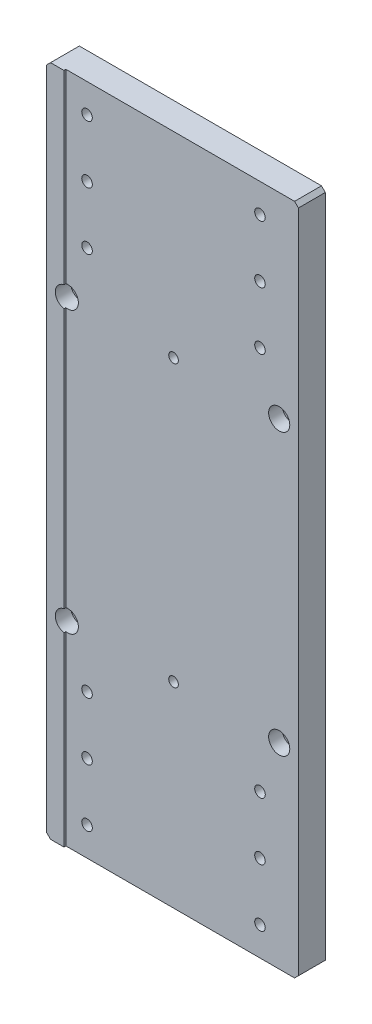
ISO-10303-21;
HEADER;
FILE_DESCRIPTION(('STEP AP214'),'2;1');
FILE_NAME('part.step','',(''),(''),'','','');
FILE_SCHEMA(('AUTOMOTIVE_DESIGN { 1 0 10303 214 1 1 1 1 }'));
ENDSEC;
DATA;
#1=APPLICATION_CONTEXT('core data for automotive mechanical design processes');
#2=APPLICATION_PROTOCOL_DEFINITION('international standard','automotive_design',2000,#1);
#3=PRODUCT_CONTEXT('',#1,'mechanical');
#4=PRODUCT('Part','Part','',(#3));
#5=PRODUCT_RELATED_PRODUCT_CATEGORY('part','',(#4));
#6=PRODUCT_DEFINITION_FORMATION('','',#4);
#7=PRODUCT_DEFINITION_CONTEXT('part definition',#1,'design');
#8=PRODUCT_DEFINITION('design','',#6,#7);
#9=PRODUCT_DEFINITION_SHAPE('','',#8);
#10=(LENGTH_UNIT() NAMED_UNIT(*) SI_UNIT(.MILLI.,.METRE.));
#11=(NAMED_UNIT(*) PLANE_ANGLE_UNIT() SI_UNIT($,.RADIAN.));
#12=(NAMED_UNIT(*) SI_UNIT($,.STERADIAN.) SOLID_ANGLE_UNIT());
#13=UNCERTAINTY_MEASURE_WITH_UNIT(LENGTH_MEASURE(1.E-05),#10,'distance_accuracy_value','');
#14=(GEOMETRIC_REPRESENTATION_CONTEXT(3) GLOBAL_UNCERTAINTY_ASSIGNED_CONTEXT((#13)) GLOBAL_UNIT_ASSIGNED_CONTEXT((#10,
#11,#12)) REPRESENTATION_CONTEXT('',''));
#15=CARTESIAN_POINT('',(0.,0.,0.));
#16=DIRECTION('',(0.,0.,1.));
#17=DIRECTION('',(1.,0.,0.));
#18=AXIS2_PLACEMENT_3D('',#15,#16,#17);
#19=CARTESIAN_POINT('',(-56.,175.,6.5));
#20=DIRECTION('',(-1.,0.,0.));
#21=DIRECTION('',(0.,-1.,0.));
#22=AXIS2_PLACEMENT_3D('',#19,#20,#21);
#23=PLANE('',#22);
#24=DIRECTION('',(0.,-1.,0.));
#25=VECTOR('',#24,1.);
#26=CARTESIAN_POINT('',(-56.,175.,6.5));
#27=LINE('',#26,#25);
#28=CARTESIAN_POINT('',(-56.,67.591673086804,6.5));
#29=VERTEX_POINT('',#28);
#30=CARTESIAN_POINT('',(-56.,-67.591673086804,6.5));
#31=VERTEX_POINT('',#30);
#32=EDGE_CURVE('E167',#29,#31,#27,.T.);
#33=ORIENTED_EDGE('',*,*,#32,.F.);
#34=DIRECTION('',(0.,0.,1.));
#35=VECTOR('',#34,1.);
#36=CARTESIAN_POINT('',(-56.,67.591673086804,7.5));
#37=LINE('',#36,#35);
#38=CARTESIAN_POINT('',(-56.,67.591673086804,7.5));
#39=VERTEX_POINT('',#38);
#40=EDGE_CURVE('E145',#29,#39,#37,.T.);
#41=ORIENTED_EDGE('',*,*,#40,.T.);
#42=DIRECTION('',(0.,-1.,0.));
#43=VECTOR('',#42,1.);
#44=CARTESIAN_POINT('',(-56.,175.,7.5));
#45=LINE('',#44,#43);
#46=CARTESIAN_POINT('',(-56.,-67.591673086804,7.5));
#47=VERTEX_POINT('',#46);
#48=EDGE_CURVE('E157',#39,#47,#45,.T.);
#49=ORIENTED_EDGE('',*,*,#48,.T.);
#50=DIRECTION('',(0.,0.,1.));
#51=VECTOR('',#50,1.);
#52=CARTESIAN_POINT('',(-56.,-67.591673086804,7.5));
#53=LINE('',#52,#51);
#54=EDGE_CURVE('E191',#47,#31,#53,.F.);
#55=ORIENTED_EDGE('',*,*,#54,.T.);
#56=EDGE_LOOP('',(#33,#41,#49,#55));
#57=FACE_BOUND('',#56,.T.);
#58=ADVANCED_FACE('F33',(#57),#23,.F.);
#59=CARTESIAN_POINT('',(-56.,-78.408326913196,6.5));
#60=VERTEX_POINT('',#59);
#61=CARTESIAN_POINT('',(-56.,-175.,6.5));
#62=VERTEX_POINT('',#61);
#63=EDGE_CURVE('E164',#60,#62,#27,.T.);
#64=ORIENTED_EDGE('',*,*,#63,.F.);
#65=DIRECTION('',(0.,0.,1.));
#66=VECTOR('',#65,1.);
#67=CARTESIAN_POINT('',(-56.,-78.408326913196,7.5));
#68=LINE('',#67,#66);
#69=CARTESIAN_POINT('',(-56.,-78.408326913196,7.5));
#70=VERTEX_POINT('',#69);
#71=EDGE_CURVE('E194',#60,#70,#68,.T.);
#72=ORIENTED_EDGE('',*,*,#71,.T.);
#73=CARTESIAN_POINT('',(-56.,-175.,7.5));
#74=VERTEX_POINT('',#73);
#75=EDGE_CURVE('E166',#70,#74,#45,.T.);
#76=ORIENTED_EDGE('',*,*,#75,.T.);
#77=DIRECTION('',(0.,0.,1.));
#78=VECTOR('',#77,1.);
#79=CARTESIAN_POINT('',(-56.,-175.,6.5));
#80=LINE('',#79,#78);
#81=EDGE_CURVE('E285',#62,#74,#80,.T.);
#82=ORIENTED_EDGE('',*,*,#81,.F.);
#83=EDGE_LOOP('',(#64,#72,#76,#82));
#84=FACE_BOUND('',#83,.T.);
#85=ADVANCED_FACE('F513',(#84),#23,.F.);
#86=CARTESIAN_POINT('',(65.,175.,7.5));
#87=DIRECTION('',(-1.,0.,0.));
#88=DIRECTION('',(0.,-1.,0.));
#89=AXIS2_PLACEMENT_3D('',#86,#87,#88);
#90=PLANE('',#89);
#91=DIRECTION('',(0.,1.,0.));
#92=VECTOR('',#91,1.);
#93=CARTESIAN_POINT('',(65.,175.,6.5));
#94=LINE('',#93,#92);
#95=CARTESIAN_POINT('',(65.,-173.,6.5));
#96=VERTEX_POINT('',#95);
#97=CARTESIAN_POINT('',(65.,173.,6.5));
#98=VERTEX_POINT('',#97);
#99=EDGE_CURVE('E289',#96,#98,#94,.T.);
#100=ORIENTED_EDGE('',*,*,#99,.F.);
#101=DIRECTION('',(0.,0.,-1.));
#102=VECTOR('',#101,1.);
#103=CARTESIAN_POINT('',(65.,-173.,7.5));
#104=LINE('',#103,#102);
#105=CARTESIAN_POINT('',(65.,-173.,-7.5));
#106=VERTEX_POINT('',#105);
#107=EDGE_CURVE('E254',#96,#106,#104,.T.);
#108=ORIENTED_EDGE('',*,*,#107,.T.);
#109=DIRECTION('',(0.,1.,0.));
#110=VECTOR('',#109,1.);
#111=CARTESIAN_POINT('',(65.,175.,-7.5));
#112=LINE('',#111,#110);
#113=CARTESIAN_POINT('',(65.,173.,-7.5));
#114=VERTEX_POINT('',#113);
#115=EDGE_CURVE('E275',#106,#114,#112,.T.);
#116=ORIENTED_EDGE('',*,*,#115,.T.);
#117=DIRECTION('',(0.,0.,1.));
#118=VECTOR('',#117,1.);
#119=CARTESIAN_POINT('',(65.,173.,7.5));
#120=LINE('',#119,#118);
#121=EDGE_CURVE('E56',#114,#98,#120,.T.);
#122=ORIENTED_EDGE('',*,*,#121,.T.);
#123=EDGE_LOOP('',(#100,#108,#116,#122));
#124=FACE_BOUND('',#123,.T.);
#125=ADVANCED_FACE('F519',(#124),#90,.F.);
#126=CARTESIAN_POINT('',(-65.,175.,7.5));
#127=DIRECTION('',(0.,-1.,0.));
#128=DIRECTION('',(0.,0.,-1.));
#129=AXIS2_PLACEMENT_3D('',#126,#127,#128);
#130=PLANE('',#129);
#131=DIRECTION('',(-1.,0.,0.));
#132=VECTOR('',#131,1.);
#133=CARTESIAN_POINT('',(-65.,175.,-7.5));
#134=LINE('',#133,#132);
#135=CARTESIAN_POINT('',(63.0000000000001,175.,-7.5));
#136=VERTEX_POINT('',#135);
#137=CARTESIAN_POINT('',(-63.,175.,-7.5));
#138=VERTEX_POINT('',#137);
#139=EDGE_CURVE('E265',#136,#138,#134,.T.);
#140=ORIENTED_EDGE('',*,*,#139,.T.);
#141=DIRECTION('',(0.,0.,1.));
#142=VECTOR('',#141,1.);
#143=CARTESIAN_POINT('',(-63.,175.,7.5));
#144=LINE('',#143,#142);
#145=CARTESIAN_POINT('',(-63.,175.,7.5));
#146=VERTEX_POINT('',#145);
#147=EDGE_CURVE('E11',#138,#146,#144,.T.);
#148=ORIENTED_EDGE('',*,*,#147,.T.);
#149=DIRECTION('',(-1.,0.,0.));
#150=VECTOR('',#149,1.);
#151=CARTESIAN_POINT('',(-65.,175.,7.5));
#152=LINE('',#151,#150);
#153=CARTESIAN_POINT('',(-56.,175.,7.5));
#154=VERTEX_POINT('',#153);
#155=EDGE_CURVE('E283',#154,#146,#152,.T.);
#156=ORIENTED_EDGE('',*,*,#155,.F.);
#157=DIRECTION('',(0.,0.,1.));
#158=VECTOR('',#157,1.);
#159=CARTESIAN_POINT('',(-56.,175.,6.5));
#160=LINE('',#159,#158);
#161=CARTESIAN_POINT('',(-56.,175.,6.5));
#162=VERTEX_POINT('',#161);
#163=EDGE_CURVE('E163',#162,#154,#160,.T.);
#164=ORIENTED_EDGE('',*,*,#163,.F.);
#165=DIRECTION('',(-1.,0.,0.));
#166=VECTOR('',#165,1.);
#167=CARTESIAN_POINT('',(-56.,175.,6.5));
#168=LINE('',#167,#166);
#169=CARTESIAN_POINT('',(63.0000000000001,175.,6.5));
#170=VERTEX_POINT('',#169);
#171=EDGE_CURVE('E267',#170,#162,#168,.T.);
#172=ORIENTED_EDGE('',*,*,#171,.F.);
#173=DIRECTION('',(0.,0.,-1.));
#174=VECTOR('',#173,1.);
#175=CARTESIAN_POINT('',(63.0000000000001,175.,7.5));
#176=LINE('',#175,#174);
#177=EDGE_CURVE('E41',#170,#136,#176,.T.);
#178=ORIENTED_EDGE('',*,*,#177,.T.);
#179=EDGE_LOOP('',(#140,#148,#156,#164,#172,#178));
#180=FACE_BOUND('',#179,.T.);
#181=ADVANCED_FACE('F264',(#180),#130,.F.);
#182=CARTESIAN_POINT('',(-65.,175.,7.5));
#183=DIRECTION('',(1.,0.,0.));
#184=DIRECTION('',(0.,1.,0.));
#185=AXIS2_PLACEMENT_3D('',#182,#183,#184);
#186=PLANE('',#185);
#187=DIRECTION('',(0.,-1.,0.));
#188=VECTOR('',#187,1.);
#189=CARTESIAN_POINT('',(-65.,175.,-7.5));
#190=LINE('',#189,#188);
#191=CARTESIAN_POINT('',(-65.,173.,-7.5));
#192=VERTEX_POINT('',#191);
#193=CARTESIAN_POINT('',(-65.,-173.,-7.5));
#194=VERTEX_POINT('',#193);
#195=EDGE_CURVE('E274',#192,#194,#190,.T.);
#196=ORIENTED_EDGE('',*,*,#195,.T.);
#197=DIRECTION('',(0.,0.,1.));
#198=VECTOR('',#197,1.);
#199=CARTESIAN_POINT('',(-65.,-173.,7.5));
#200=LINE('',#199,#198);
#201=CARTESIAN_POINT('',(-65.,-173.,7.5));
#202=VERTEX_POINT('',#201);
#203=EDGE_CURVE('E247',#194,#202,#200,.T.);
#204=ORIENTED_EDGE('',*,*,#203,.T.);
#205=DIRECTION('',(0.,-1.,0.));
#206=VECTOR('',#205,1.);
#207=CARTESIAN_POINT('',(-65.,175.,7.5));
#208=LINE('',#207,#206);
#209=CARTESIAN_POINT('',(-65.,173.,7.5));
#210=VERTEX_POINT('',#209);
#211=EDGE_CURVE('E281',#210,#202,#208,.T.);
#212=ORIENTED_EDGE('',*,*,#211,.F.);
#213=DIRECTION('',(0.,0.,-1.));
#214=VECTOR('',#213,1.);
#215=CARTESIAN_POINT('',(-65.,173.,7.5));
#216=LINE('',#215,#214);
#217=EDGE_CURVE('E244',#210,#192,#216,.T.);
#218=ORIENTED_EDGE('',*,*,#217,.T.);
#219=EDGE_LOOP('',(#196,#204,#212,#218));
#220=FACE_BOUND('',#219,.T.);
#221=ADVANCED_FACE('F536',(#220),#186,.F.);
#222=CARTESIAN_POINT('',(-65.,-175.,7.5));
#223=DIRECTION('',(0.,1.,0.));
#224=DIRECTION('',(0.,0.,1.));
#225=AXIS2_PLACEMENT_3D('',#222,#223,#224);
#226=PLANE('',#225);
#227=DIRECTION('',(1.,0.,0.));
#228=VECTOR('',#227,1.);
#229=CARTESIAN_POINT('',(-65.,-175.,7.5));
#230=LINE('',#229,#228);
#231=CARTESIAN_POINT('',(-63.,-175.,7.5));
#232=VERTEX_POINT('',#231);
#233=EDGE_CURVE('E195',#232,#74,#230,.T.);
#234=ORIENTED_EDGE('',*,*,#233,.F.);
#235=DIRECTION('',(0.,0.,-1.));
#236=VECTOR('',#235,1.);
#237=CARTESIAN_POINT('',(-63.,-175.,7.5));
#238=LINE('',#237,#236);
#239=CARTESIAN_POINT('',(-63.,-175.,-7.5));
#240=VERTEX_POINT('',#239);
#241=EDGE_CURVE('E233',#232,#240,#238,.T.);
#242=ORIENTED_EDGE('',*,*,#241,.T.);
#243=DIRECTION('',(1.,0.,0.));
#244=VECTOR('',#243,1.);
#245=CARTESIAN_POINT('',(-65.,-175.,-7.5));
#246=LINE('',#245,#244);
#247=CARTESIAN_POINT('',(63.,-175.,-7.5));
#248=VERTEX_POINT('',#247);
#249=EDGE_CURVE('E189',#240,#248,#246,.T.);
#250=ORIENTED_EDGE('',*,*,#249,.T.);
#251=DIRECTION('',(0.,0.,1.));
#252=VECTOR('',#251,1.);
#253=CARTESIAN_POINT('',(63.,-175.,7.5));
#254=LINE('',#253,#252);
#255=CARTESIAN_POINT('',(63.,-175.,6.5));
#256=VERTEX_POINT('',#255);
#257=EDGE_CURVE('E203',#248,#256,#254,.T.);
#258=ORIENTED_EDGE('',*,*,#257,.T.);
#259=DIRECTION('',(1.,0.,0.));
#260=VECTOR('',#259,1.);
#261=CARTESIAN_POINT('',(-56.,-175.,6.5));
#262=LINE('',#261,#260);
#263=EDGE_CURVE('E290',#62,#256,#262,.T.);
#264=ORIENTED_EDGE('',*,*,#263,.F.);
#265=ORIENTED_EDGE('',*,*,#81,.T.);
#266=EDGE_LOOP('',(#234,#242,#250,#258,#264,#265));
#267=FACE_BOUND('',#266,.T.);
#268=ADVANCED_FACE('F531',(#267),#226,.F.);
#269=CARTESIAN_POINT('',(0.,0.,7.5));
#270=DIRECTION('',(0.,0.,1.));
#271=DIRECTION('',(1.,0.,0.));
#272=AXIS2_PLACEMENT_3D('',#269,#270,#271);
#273=PLANE('',#272);
#274=ORIENTED_EDGE('',*,*,#211,.T.);
#275=DIRECTION('',(-0.707106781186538,0.707106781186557,0.));
#276=VECTOR('',#275,1.);
#277=CARTESIAN_POINT('',(-119.000000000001,-118.999999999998,7.5));
#278=LINE('',#277,#276);
#279=EDGE_CURVE('E251',#202,#232,#278,.F.);
#280=ORIENTED_EDGE('',*,*,#279,.T.);
#281=ORIENTED_EDGE('',*,*,#233,.T.);
#282=ORIENTED_EDGE('',*,*,#75,.F.);
#283=CARTESIAN_POINT('',(-55.,-73.,7.5));
#284=DIRECTION('',(0.,0.,1.));
#285=DIRECTION('',(1.,0.,0.));
#286=AXIS2_PLACEMENT_3D('',#283,#284,#285);
#287=CIRCLE('',#286,5.5);
#288=EDGE_CURVE('E200',#47,#70,#287,.T.);
#289=ORIENTED_EDGE('',*,*,#288,.F.);
#290=ORIENTED_EDGE('',*,*,#48,.F.);
#291=CARTESIAN_POINT('',(-55.,73.,7.5));
#292=DIRECTION('',(0.,0.,1.));
#293=DIRECTION('',(1.,0.,0.));
#294=AXIS2_PLACEMENT_3D('',#291,#292,#293);
#295=CIRCLE('',#294,5.5);
#296=CARTESIAN_POINT('',(-56.,78.408326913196,7.5));
#297=VERTEX_POINT('',#296);
#298=EDGE_CURVE('E137',#297,#39,#295,.T.);
#299=ORIENTED_EDGE('',*,*,#298,.F.);
#300=EDGE_CURVE('E154',#154,#297,#45,.T.);
#301=ORIENTED_EDGE('',*,*,#300,.F.);
#302=ORIENTED_EDGE('',*,*,#155,.T.);
#303=DIRECTION('',(0.707106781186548,0.707106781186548,0.));
#304=VECTOR('',#303,1.);
#305=CARTESIAN_POINT('',(-119.,119.,7.5));
#306=LINE('',#305,#304);
#307=EDGE_CURVE('E249',#146,#210,#306,.F.);
#308=ORIENTED_EDGE('',*,*,#307,.T.);
#309=EDGE_LOOP('',(#274,#280,#281,#282,#289,#290,#299,#301,#302,#308));
#310=FACE_BOUND('',#309,.T.);
#311=ADVANCED_FACE('F152',(#310),#273,.T.);
#312=CARTESIAN_POINT('',(0.,0.,-7.5));
#313=DIRECTION('',(0.,0.,1.));
#314=DIRECTION('',(1.,0.,0.));
#315=AXIS2_PLACEMENT_3D('',#312,#313,#314);
#316=PLANE('',#315);
#317=CARTESIAN_POINT('',(0.,73.,-7.5));
#318=DIRECTION('',(0.,0.,1.));
#319=DIRECTION('',(1.,0.,0.));
#320=AXIS2_PLACEMENT_3D('',#317,#318,#319);
#321=CIRCLE('',#320,2.5);
#322=CARTESIAN_POINT('',(2.5,73.,-7.5));
#323=VERTEX_POINT('',#322);
#324=EDGE_CURVE('E450',#323,#323,#321,.T.);
#325=ORIENTED_EDGE('',*,*,#324,.T.);
#326=EDGE_LOOP('',(#325));
#327=FACE_BOUND('',#326,.T.);
#328=CARTESIAN_POINT('',(0.,-73.,-7.5));
#329=DIRECTION('',(0.,0.,1.));
#330=DIRECTION('',(1.,0.,0.));
#331=AXIS2_PLACEMENT_3D('',#328,#329,#330);
#332=CIRCLE('',#331,2.5);
#333=CARTESIAN_POINT('',(2.5,-73.,-7.5));
#334=VERTEX_POINT('',#333);
#335=EDGE_CURVE('E444',#334,#334,#332,.T.);
#336=ORIENTED_EDGE('',*,*,#335,.T.);
#337=EDGE_LOOP('',(#336));
#338=FACE_BOUND('',#337,.T.);
#339=CARTESIAN_POINT('',(-45.,-100.,-7.5));
#340=DIRECTION('',(0.,0.,-1.));
#341=DIRECTION('',(-1.,0.,0.));
#342=AXIS2_PLACEMENT_3D('',#339,#340,#341);
#343=CIRCLE('',#342,4.75);
#344=CARTESIAN_POINT('',(-49.75,-100.,-7.5));
#345=VERTEX_POINT('',#344);
#346=EDGE_CURVE('E441',#345,#345,#343,.T.);
#347=ORIENTED_EDGE('',*,*,#346,.F.);
#348=EDGE_LOOP('',(#347));
#349=FACE_BOUND('',#348,.T.);
#350=CARTESIAN_POINT('',(45.,-130.,-7.5));
#351=DIRECTION('',(0.,0.,-1.));
#352=DIRECTION('',(-1.,0.,0.));
#353=AXIS2_PLACEMENT_3D('',#350,#351,#352);
#354=CIRCLE('',#353,4.75);
#355=CARTESIAN_POINT('',(40.25,-130.,-7.5));
#356=VERTEX_POINT('',#355);
#357=EDGE_CURVE('E429',#356,#356,#354,.T.);
#358=ORIENTED_EDGE('',*,*,#357,.F.);
#359=EDGE_LOOP('',(#358));
#360=FACE_BOUND('',#359,.T.);
#361=CARTESIAN_POINT('',(-45.,-130.,-7.5));
#362=DIRECTION('',(0.,0.,-1.));
#363=DIRECTION('',(-1.,0.,0.));
#364=AXIS2_PLACEMENT_3D('',#361,#362,#363);
#365=CIRCLE('',#364,4.75);
#366=CARTESIAN_POINT('',(-49.75,-130.,-7.5));
#367=VERTEX_POINT('',#366);
#368=EDGE_CURVE('E417',#367,#367,#365,.T.);
#369=ORIENTED_EDGE('',*,*,#368,.F.);
#370=EDGE_LOOP('',(#369));
#371=FACE_BOUND('',#370,.T.);
#372=CARTESIAN_POINT('',(-45.,-160.,-7.5));
#373=DIRECTION('',(0.,0.,-1.));
#374=DIRECTION('',(-1.,0.,0.));
#375=AXIS2_PLACEMENT_3D('',#372,#373,#374);
#376=CIRCLE('',#375,4.75);
#377=CARTESIAN_POINT('',(-49.75,-160.,-7.5));
#378=VERTEX_POINT('',#377);
#379=EDGE_CURVE('E405',#378,#378,#376,.T.);
#380=ORIENTED_EDGE('',*,*,#379,.F.);
#381=EDGE_LOOP('',(#380));
#382=FACE_BOUND('',#381,.T.);
#383=CARTESIAN_POINT('',(45.,-160.,-7.5));
#384=DIRECTION('',(0.,0.,-1.));
#385=DIRECTION('',(-1.,0.,0.));
#386=AXIS2_PLACEMENT_3D('',#383,#384,#385);
#387=CIRCLE('',#386,4.75);
#388=CARTESIAN_POINT('',(40.25,-160.,-7.5));
#389=VERTEX_POINT('',#388);
#390=EDGE_CURVE('E393',#389,#389,#387,.T.);
#391=ORIENTED_EDGE('',*,*,#390,.F.);
#392=EDGE_LOOP('',(#391));
#393=FACE_BOUND('',#392,.T.);
#394=CARTESIAN_POINT('',(45.,-100.,-7.5));
#395=DIRECTION('',(0.,0.,-1.));
#396=DIRECTION('',(-1.,0.,0.));
#397=AXIS2_PLACEMENT_3D('',#394,#395,#396);
#398=CIRCLE('',#397,4.75);
#399=CARTESIAN_POINT('',(40.25,-100.,-7.5));
#400=VERTEX_POINT('',#399);
#401=EDGE_CURVE('E381',#400,#400,#398,.T.);
#402=ORIENTED_EDGE('',*,*,#401,.F.);
#403=EDGE_LOOP('',(#402));
#404=FACE_BOUND('',#403,.T.);
#405=CARTESIAN_POINT('',(45.,160.,-7.5));
#406=DIRECTION('',(0.,0.,-1.));
#407=DIRECTION('',(-1.,0.,0.));
#408=AXIS2_PLACEMENT_3D('',#405,#406,#407);
#409=CIRCLE('',#408,4.75);
#410=CARTESIAN_POINT('',(40.25,160.,-7.5));
#411=VERTEX_POINT('',#410);
#412=EDGE_CURVE('E369',#411,#411,#409,.T.);
#413=ORIENTED_EDGE('',*,*,#412,.F.);
#414=EDGE_LOOP('',(#413));
#415=FACE_BOUND('',#414,.T.);
#416=CARTESIAN_POINT('',(-45.,160.,-7.5));
#417=DIRECTION('',(0.,0.,-1.));
#418=DIRECTION('',(-1.,0.,0.));
#419=AXIS2_PLACEMENT_3D('',#416,#417,#418);
#420=CIRCLE('',#419,4.75);
#421=CARTESIAN_POINT('',(-49.75,160.,-7.5));
#422=VERTEX_POINT('',#421);
#423=EDGE_CURVE('E230',#422,#422,#420,.T.);
#424=ORIENTED_EDGE('',*,*,#423,.F.);
#425=EDGE_LOOP('',(#424));
#426=FACE_BOUND('',#425,.T.);
#427=CARTESIAN_POINT('',(45.,130.,-7.5));
#428=DIRECTION('',(0.,0.,-1.));
#429=DIRECTION('',(-1.,0.,0.));
#430=AXIS2_PLACEMENT_3D('',#427,#428,#429);
#431=CIRCLE('',#430,4.75);
#432=CARTESIAN_POINT('',(40.25,130.,-7.5));
#433=VERTEX_POINT('',#432);
#434=EDGE_CURVE('E225',#433,#433,#431,.T.);
#435=ORIENTED_EDGE('',*,*,#434,.F.);
#436=EDGE_LOOP('',(#435));
#437=FACE_BOUND('',#436,.T.);
#438=CARTESIAN_POINT('',(-45.,130.,-7.5));
#439=DIRECTION('',(0.,0.,-1.));
#440=DIRECTION('',(-1.,0.,0.));
#441=AXIS2_PLACEMENT_3D('',#438,#439,#440);
#442=CIRCLE('',#441,4.75);
#443=CARTESIAN_POINT('',(-49.75,130.,-7.5));
#444=VERTEX_POINT('',#443);
#445=EDGE_CURVE('E220',#444,#444,#442,.T.);
#446=ORIENTED_EDGE('',*,*,#445,.F.);
#447=EDGE_LOOP('',(#446));
#448=FACE_BOUND('',#447,.T.);
#449=CARTESIAN_POINT('',(-45.,100.,-7.5));
#450=DIRECTION('',(0.,0.,-1.));
#451=DIRECTION('',(-1.,0.,0.));
#452=AXIS2_PLACEMENT_3D('',#449,#450,#451);
#453=CIRCLE('',#452,4.75);
#454=CARTESIAN_POINT('',(-49.75,100.,-7.5));
#455=VERTEX_POINT('',#454);
#456=EDGE_CURVE('E215',#455,#455,#453,.T.);
#457=ORIENTED_EDGE('',*,*,#456,.F.);
#458=EDGE_LOOP('',(#457));
#459=FACE_BOUND('',#458,.T.);
#460=CARTESIAN_POINT('',(45.,100.,-7.5));
#461=DIRECTION('',(0.,0.,-1.));
#462=DIRECTION('',(-1.,0.,0.));
#463=AXIS2_PLACEMENT_3D('',#460,#461,#462);
#464=CIRCLE('',#463,4.75);
#465=CARTESIAN_POINT('',(40.25,100.,-7.5));
#466=VERTEX_POINT('',#465);
#467=EDGE_CURVE('E210',#466,#466,#464,.T.);
#468=ORIENTED_EDGE('',*,*,#467,.F.);
#469=EDGE_LOOP('',(#468));
#470=FACE_BOUND('',#469,.T.);
#471=CARTESIAN_POINT('',(-55.,73.,-7.5));
#472=DIRECTION('',(0.,0.,1.));
#473=DIRECTION('',(1.,0.,0.));
#474=AXIS2_PLACEMENT_3D('',#471,#472,#473);
#475=CIRCLE('',#474,3.3);
#476=CARTESIAN_POINT('',(-51.7,73.,-7.5));
#477=VERTEX_POINT('',#476);
#478=EDGE_CURVE('E146',#477,#477,#475,.T.);
#479=ORIENTED_EDGE('',*,*,#478,.T.);
#480=EDGE_LOOP('',(#479));
#481=FACE_BOUND('',#480,.T.);
#482=CARTESIAN_POINT('',(55.,73.,-7.5));
#483=DIRECTION('',(0.,0.,1.));
#484=DIRECTION('',(1.,0.,0.));
#485=AXIS2_PLACEMENT_3D('',#482,#483,#484);
#486=CIRCLE('',#485,3.3);
#487=CARTESIAN_POINT('',(58.3,73.,-7.5));
#488=VERTEX_POINT('',#487);
#489=EDGE_CURVE('E201',#488,#488,#486,.T.);
#490=ORIENTED_EDGE('',*,*,#489,.T.);
#491=EDGE_LOOP('',(#490));
#492=FACE_BOUND('',#491,.T.);
#493=CARTESIAN_POINT('',(-55.,-73.,-7.5));
#494=DIRECTION('',(0.,0.,1.));
#495=DIRECTION('',(1.,0.,0.));
#496=AXIS2_PLACEMENT_3D('',#493,#494,#495);
#497=CIRCLE('',#496,3.3);
#498=CARTESIAN_POINT('',(-51.7,-73.,-7.5));
#499=VERTEX_POINT('',#498);
#500=EDGE_CURVE('E303',#499,#499,#497,.T.);
#501=ORIENTED_EDGE('',*,*,#500,.T.);
#502=EDGE_LOOP('',(#501));
#503=FACE_BOUND('',#502,.T.);
#504=CARTESIAN_POINT('',(55.,-73.,-7.5));
#505=DIRECTION('',(0.,0.,1.));
#506=DIRECTION('',(1.,0.,0.));
#507=AXIS2_PLACEMENT_3D('',#504,#505,#506);
#508=CIRCLE('',#507,3.3);
#509=CARTESIAN_POINT('',(58.3,-73.,-7.5));
#510=VERTEX_POINT('',#509);
#511=EDGE_CURVE('E180',#510,#510,#508,.T.);
#512=ORIENTED_EDGE('',*,*,#511,.T.);
#513=EDGE_LOOP('',(#512));
#514=FACE_BOUND('',#513,.T.);
#515=ORIENTED_EDGE('',*,*,#249,.F.);
#516=DIRECTION('',(0.707106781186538,-0.707106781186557,0.));
#517=VECTOR('',#516,1.);
#518=CARTESIAN_POINT('',(-63.,-175.,-7.5));
#519=LINE('',#518,#517);
#520=EDGE_CURVE('E242',#240,#194,#519,.F.);
#521=ORIENTED_EDGE('',*,*,#520,.T.);
#522=ORIENTED_EDGE('',*,*,#195,.F.);
#523=DIRECTION('',(-0.707106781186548,-0.707106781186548,0.));
#524=VECTOR('',#523,1.);
#525=CARTESIAN_POINT('',(-65.,173.,-7.5));
#526=LINE('',#525,#524);
#527=EDGE_CURVE('E238',#192,#138,#526,.F.);
#528=ORIENTED_EDGE('',*,*,#527,.T.);
#529=ORIENTED_EDGE('',*,*,#139,.F.);
#530=DIRECTION('',(-0.707106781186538,0.707106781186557,0.));
#531=VECTOR('',#530,1.);
#532=CARTESIAN_POINT('',(63.0000000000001,175.,-7.5));
#533=LINE('',#532,#531);
#534=EDGE_CURVE('E236',#136,#114,#533,.F.);
#535=ORIENTED_EDGE('',*,*,#534,.T.);
#536=ORIENTED_EDGE('',*,*,#115,.F.);
#537=DIRECTION('',(0.707106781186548,0.707106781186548,0.));
#538=VECTOR('',#537,1.);
#539=CARTESIAN_POINT('',(65.,-173.,-7.5));
#540=LINE('',#539,#538);
#541=EDGE_CURVE('E240',#106,#248,#540,.F.);
#542=ORIENTED_EDGE('',*,*,#541,.T.);
#543=EDGE_LOOP('',(#515,#521,#522,#528,#529,#535,#536,#542));
#544=FACE_BOUND('',#543,.T.);
#545=ADVANCED_FACE('F271',(#327,#338,#349,#360,#371,#382,#393,#404,#415,#426,#437,#448,#459,
#470,#481,#492,#503,#514,#544),#316,.F.);
#546=ORIENTED_EDGE('',*,*,#300,.T.);
#547=DIRECTION('',(0.,0.,1.));
#548=VECTOR('',#547,1.);
#549=CARTESIAN_POINT('',(-56.,78.408326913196,7.5));
#550=LINE('',#549,#548);
#551=CARTESIAN_POINT('',(-56.,78.408326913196,6.5));
#552=VERTEX_POINT('',#551);
#553=EDGE_CURVE('E134',#297,#552,#550,.F.);
#554=ORIENTED_EDGE('',*,*,#553,.T.);
#555=EDGE_CURVE('E169',#162,#552,#27,.T.);
#556=ORIENTED_EDGE('',*,*,#555,.F.);
#557=ORIENTED_EDGE('',*,*,#163,.T.);
#558=EDGE_LOOP('',(#546,#554,#556,#557));
#559=FACE_BOUND('',#558,.T.);
#560=ADVANCED_FACE('F161',(#559),#23,.F.);
#561=CARTESIAN_POINT('',(0.,0.,6.5));
#562=DIRECTION('',(0.,0.,1.));
#563=DIRECTION('',(1.,0.,0.));
#564=AXIS2_PLACEMENT_3D('',#561,#562,#563);
#565=PLANE('',#564);
#566=CARTESIAN_POINT('',(0.,73.,6.5));
#567=DIRECTION('',(0.,0.,1.));
#568=DIRECTION('',(1.,0.,0.));
#569=AXIS2_PLACEMENT_3D('',#566,#567,#568);
#570=CIRCLE('',#569,2.49999999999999);
#571=CARTESIAN_POINT('',(2.49999999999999,73.,6.5));
#572=VERTEX_POINT('',#571);
#573=EDGE_CURVE('E453',#572,#572,#570,.T.);
#574=ORIENTED_EDGE('',*,*,#573,.F.);
#575=EDGE_LOOP('',(#574));
#576=FACE_BOUND('',#575,.T.);
#577=CARTESIAN_POINT('',(0.,-73.,6.5));
#578=DIRECTION('',(0.,0.,1.));
#579=DIRECTION('',(1.,0.,0.));
#580=AXIS2_PLACEMENT_3D('',#577,#578,#579);
#581=CIRCLE('',#580,2.49999999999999);
#582=CARTESIAN_POINT('',(2.49999999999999,-73.,6.5));
#583=VERTEX_POINT('',#582);
#584=EDGE_CURVE('E447',#583,#583,#581,.T.);
#585=ORIENTED_EDGE('',*,*,#584,.F.);
#586=EDGE_LOOP('',(#585));
#587=FACE_BOUND('',#586,.T.);
#588=CARTESIAN_POINT('',(-45.,-100.,6.5));
#589=DIRECTION('',(0.,0.,1.));
#590=DIRECTION('',(1.,0.,0.));
#591=AXIS2_PLACEMENT_3D('',#588,#589,#590);
#592=CIRCLE('',#591,2.75);
#593=CARTESIAN_POINT('',(-42.25,-100.,6.5));
#594=VERTEX_POINT('',#593);
#595=EDGE_CURVE('E438',#594,#594,#592,.T.);
#596=ORIENTED_EDGE('',*,*,#595,.F.);
#597=EDGE_LOOP('',(#596));
#598=FACE_BOUND('',#597,.T.);
#599=CARTESIAN_POINT('',(45.,-130.,6.5));
#600=DIRECTION('',(0.,0.,1.));
#601=DIRECTION('',(1.,0.,0.));
#602=AXIS2_PLACEMENT_3D('',#599,#600,#601);
#603=CIRCLE('',#602,2.75);
#604=CARTESIAN_POINT('',(47.75,-130.,6.5));
#605=VERTEX_POINT('',#604);
#606=EDGE_CURVE('E426',#605,#605,#603,.T.);
#607=ORIENTED_EDGE('',*,*,#606,.F.);
#608=EDGE_LOOP('',(#607));
#609=FACE_BOUND('',#608,.T.);
#610=CARTESIAN_POINT('',(-45.,-130.,6.5));
#611=DIRECTION('',(0.,0.,1.));
#612=DIRECTION('',(1.,0.,0.));
#613=AXIS2_PLACEMENT_3D('',#610,#611,#612);
#614=CIRCLE('',#613,2.75);
#615=CARTESIAN_POINT('',(-42.25,-130.,6.5));
#616=VERTEX_POINT('',#615);
#617=EDGE_CURVE('E414',#616,#616,#614,.T.);
#618=ORIENTED_EDGE('',*,*,#617,.F.);
#619=EDGE_LOOP('',(#618));
#620=FACE_BOUND('',#619,.T.);
#621=CARTESIAN_POINT('',(-45.,-160.,6.5));
#622=DIRECTION('',(0.,0.,1.));
#623=DIRECTION('',(1.,0.,0.));
#624=AXIS2_PLACEMENT_3D('',#621,#622,#623);
#625=CIRCLE('',#624,2.75);
#626=CARTESIAN_POINT('',(-42.25,-160.,6.5));
#627=VERTEX_POINT('',#626);
#628=EDGE_CURVE('E402',#627,#627,#625,.T.);
#629=ORIENTED_EDGE('',*,*,#628,.F.);
#630=EDGE_LOOP('',(#629));
#631=FACE_BOUND('',#630,.T.);
#632=CARTESIAN_POINT('',(45.,-160.,6.5));
#633=DIRECTION('',(0.,0.,1.));
#634=DIRECTION('',(1.,0.,0.));
#635=AXIS2_PLACEMENT_3D('',#632,#633,#634);
#636=CIRCLE('',#635,2.75);
#637=CARTESIAN_POINT('',(47.75,-160.,6.5));
#638=VERTEX_POINT('',#637);
#639=EDGE_CURVE('E390',#638,#638,#636,.T.);
#640=ORIENTED_EDGE('',*,*,#639,.F.);
#641=EDGE_LOOP('',(#640));
#642=FACE_BOUND('',#641,.T.);
#643=CARTESIAN_POINT('',(45.,-100.,6.5));
#644=DIRECTION('',(0.,0.,1.));
#645=DIRECTION('',(1.,0.,0.));
#646=AXIS2_PLACEMENT_3D('',#643,#644,#645);
#647=CIRCLE('',#646,2.75);
#648=CARTESIAN_POINT('',(47.75,-100.,6.5));
#649=VERTEX_POINT('',#648);
#650=EDGE_CURVE('E378',#649,#649,#647,.T.);
#651=ORIENTED_EDGE('',*,*,#650,.F.);
#652=EDGE_LOOP('',(#651));
#653=FACE_BOUND('',#652,.T.);
#654=CARTESIAN_POINT('',(45.,160.,6.5));
#655=DIRECTION('',(0.,0.,1.));
#656=DIRECTION('',(1.,0.,0.));
#657=AXIS2_PLACEMENT_3D('',#654,#655,#656);
#658=CIRCLE('',#657,2.75);
#659=CARTESIAN_POINT('',(47.75,160.,6.5));
#660=VERTEX_POINT('',#659);
#661=EDGE_CURVE('E227',#660,#660,#658,.T.);
#662=ORIENTED_EDGE('',*,*,#661,.F.);
#663=EDGE_LOOP('',(#662));
#664=FACE_BOUND('',#663,.T.);
#665=CARTESIAN_POINT('',(-45.,160.,6.5));
#666=DIRECTION('',(0.,0.,1.));
#667=DIRECTION('',(1.,0.,0.));
#668=AXIS2_PLACEMENT_3D('',#665,#666,#667);
#669=CIRCLE('',#668,2.75);
#670=CARTESIAN_POINT('',(-42.25,160.,6.5));
#671=VERTEX_POINT('',#670);
#672=EDGE_CURVE('E222',#671,#671,#669,.T.);
#673=ORIENTED_EDGE('',*,*,#672,.F.);
#674=EDGE_LOOP('',(#673));
#675=FACE_BOUND('',#674,.T.);
#676=CARTESIAN_POINT('',(45.,130.,6.5));
#677=DIRECTION('',(0.,0.,1.));
#678=DIRECTION('',(1.,0.,0.));
#679=AXIS2_PLACEMENT_3D('',#676,#677,#678);
#680=CIRCLE('',#679,2.75);
#681=CARTESIAN_POINT('',(47.75,130.,6.5));
#682=VERTEX_POINT('',#681);
#683=EDGE_CURVE('E217',#682,#682,#680,.T.);
#684=ORIENTED_EDGE('',*,*,#683,.F.);
#685=EDGE_LOOP('',(#684));
#686=FACE_BOUND('',#685,.T.);
#687=CARTESIAN_POINT('',(-45.,130.,6.5));
#688=DIRECTION('',(0.,0.,1.));
#689=DIRECTION('',(1.,0.,0.));
#690=AXIS2_PLACEMENT_3D('',#687,#688,#689);
#691=CIRCLE('',#690,2.75);
#692=CARTESIAN_POINT('',(-42.25,130.,6.5));
#693=VERTEX_POINT('',#692);
#694=EDGE_CURVE('E212',#693,#693,#691,.T.);
#695=ORIENTED_EDGE('',*,*,#694,.F.);
#696=EDGE_LOOP('',(#695));
#697=FACE_BOUND('',#696,.T.);
#698=CARTESIAN_POINT('',(-45.,100.,6.5));
#699=DIRECTION('',(0.,0.,1.));
#700=DIRECTION('',(1.,0.,0.));
#701=AXIS2_PLACEMENT_3D('',#698,#699,#700);
#702=CIRCLE('',#701,2.75);
#703=CARTESIAN_POINT('',(-42.25,100.,6.5));
#704=VERTEX_POINT('',#703);
#705=EDGE_CURVE('E207',#704,#704,#702,.T.);
#706=ORIENTED_EDGE('',*,*,#705,.F.);
#707=EDGE_LOOP('',(#706));
#708=FACE_BOUND('',#707,.T.);
#709=CARTESIAN_POINT('',(45.,100.,6.5));
#710=DIRECTION('',(0.,0.,1.));
#711=DIRECTION('',(1.,0.,0.));
#712=AXIS2_PLACEMENT_3D('',#709,#710,#711);
#713=CIRCLE('',#712,2.75);
#714=CARTESIAN_POINT('',(47.75,100.,6.5));
#715=VERTEX_POINT('',#714);
#716=EDGE_CURVE('E159',#715,#715,#713,.T.);
#717=ORIENTED_EDGE('',*,*,#716,.F.);
#718=EDGE_LOOP('',(#717));
#719=FACE_BOUND('',#718,.T.);
#720=ORIENTED_EDGE('',*,*,#263,.T.);
#721=DIRECTION('',(-0.707106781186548,-0.707106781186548,0.));
#722=VECTOR('',#721,1.);
#723=CARTESIAN_POINT('',(119.,-119.,6.5));
#724=LINE('',#723,#722);
#725=EDGE_CURVE('E258',#256,#96,#724,.F.);
#726=ORIENTED_EDGE('',*,*,#725,.T.);
#727=ORIENTED_EDGE('',*,*,#99,.T.);
#728=DIRECTION('',(0.707106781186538,-0.707106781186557,0.));
#729=VECTOR('',#728,1.);
#730=CARTESIAN_POINT('',(119.000000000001,118.999999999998,6.5));
#731=LINE('',#730,#729);
#732=EDGE_CURVE('E48',#98,#170,#731,.F.);
#733=ORIENTED_EDGE('',*,*,#732,.T.);
#734=ORIENTED_EDGE('',*,*,#171,.T.);
#735=ORIENTED_EDGE('',*,*,#555,.T.);
#736=CARTESIAN_POINT('',(-55.,73.,6.5));
#737=DIRECTION('',(0.,0.,1.));
#738=DIRECTION('',(1.,0.,0.));
#739=AXIS2_PLACEMENT_3D('',#736,#737,#738);
#740=CIRCLE('',#739,5.5);
#741=EDGE_CURVE('E140',#29,#552,#740,.T.);
#742=ORIENTED_EDGE('',*,*,#741,.F.);
#743=ORIENTED_EDGE('',*,*,#32,.T.);
#744=CARTESIAN_POINT('',(-55.,-73.,6.5));
#745=DIRECTION('',(0.,0.,1.));
#746=DIRECTION('',(1.,0.,0.));
#747=AXIS2_PLACEMENT_3D('',#744,#745,#746);
#748=CIRCLE('',#747,5.5);
#749=EDGE_CURVE('E300',#60,#31,#748,.T.);
#750=ORIENTED_EDGE('',*,*,#749,.F.);
#751=ORIENTED_EDGE('',*,*,#63,.T.);
#752=EDGE_LOOP('',(#720,#726,#727,#733,#734,#735,#742,#743,#750,#751));
#753=FACE_BOUND('',#752,.T.);
#754=CARTESIAN_POINT('',(55.,73.,6.5));
#755=DIRECTION('',(0.,0.,1.));
#756=DIRECTION('',(1.,0.,0.));
#757=AXIS2_PLACEMENT_3D('',#754,#755,#756);
#758=CIRCLE('',#757,5.5);
#759=CARTESIAN_POINT('',(60.5,73.,6.5));
#760=VERTEX_POINT('',#759);
#761=EDGE_CURVE('E197',#760,#760,#758,.T.);
#762=ORIENTED_EDGE('',*,*,#761,.F.);
#763=EDGE_LOOP('',(#762));
#764=FACE_BOUND('',#763,.T.);
#765=CARTESIAN_POINT('',(55.,-73.,6.5));
#766=DIRECTION('',(0.,0.,1.));
#767=DIRECTION('',(1.,0.,0.));
#768=AXIS2_PLACEMENT_3D('',#765,#766,#767);
#769=CIRCLE('',#768,5.5);
#770=CARTESIAN_POINT('',(60.5,-73.,6.5));
#771=VERTEX_POINT('',#770);
#772=EDGE_CURVE('E173',#771,#771,#769,.T.);
#773=ORIENTED_EDGE('',*,*,#772,.F.);
#774=EDGE_LOOP('',(#773));
#775=FACE_BOUND('',#774,.T.);
#776=ADVANCED_FACE('F459',(#576,#587,#598,#609,#620,#631,#642,#653,#664,#675,#686,#697,#708,
#719,#753,#764,#775),#565,.T.);
#777=CARTESIAN_POINT('',(55.,-73.,7.5));
#778=DIRECTION('',(0.,0.,1.));
#779=DIRECTION('',(1.,0.,0.));
#780=AXIS2_PLACEMENT_3D('',#777,#778,#779);
#781=CYLINDRICAL_SURFACE('',#780,3.3);
#782=ORIENTED_EDGE('',*,*,#511,.F.);
#783=EDGE_LOOP('',(#782));
#784=FACE_BOUND('',#783,.T.);
#785=CARTESIAN_POINT('',(55.,-73.,-0.5));
#786=DIRECTION('',(0.,0.,1.));
#787=DIRECTION('',(1.,0.,0.));
#788=AXIS2_PLACEMENT_3D('',#785,#786,#787);
#789=CIRCLE('',#788,3.3);
#790=CARTESIAN_POINT('',(58.3,-73.,-0.5));
#791=VERTEX_POINT('',#790);
#792=EDGE_CURVE('E185',#791,#791,#789,.T.);
#793=ORIENTED_EDGE('',*,*,#792,.T.);
#794=EDGE_LOOP('',(#793));
#795=FACE_BOUND('',#794,.T.);
#796=ADVANCED_FACE('F462',(#784,#795),#781,.F.);
#797=CARTESIAN_POINT('',(58.3,-73.,-0.5));
#798=DIRECTION('',(0.,0.,-1.));
#799=DIRECTION('',(-1.,0.,0.));
#800=AXIS2_PLACEMENT_3D('',#797,#798,#799);
#801=PLANE('',#800);
#802=ORIENTED_EDGE('',*,*,#792,.F.);
#803=EDGE_LOOP('',(#802));
#804=FACE_BOUND('',#803,.T.);
#805=CARTESIAN_POINT('',(55.,-73.,-0.5));
#806=DIRECTION('',(0.,0.,1.));
#807=DIRECTION('',(1.,0.,0.));
#808=AXIS2_PLACEMENT_3D('',#805,#806,#807);
#809=CIRCLE('',#808,5.5);
#810=CARTESIAN_POINT('',(60.5,-73.,-0.5));
#811=VERTEX_POINT('',#810);
#812=EDGE_CURVE('E297',#811,#811,#809,.T.);
#813=ORIENTED_EDGE('',*,*,#812,.T.);
#814=EDGE_LOOP('',(#813));
#815=FACE_BOUND('',#814,.T.);
#816=ADVANCED_FACE('F582',(#804,#815),#801,.F.);
#817=CARTESIAN_POINT('',(55.,-73.,7.5));
#818=DIRECTION('',(0.,0.,1.));
#819=DIRECTION('',(1.,0.,0.));
#820=AXIS2_PLACEMENT_3D('',#817,#818,#819);
#821=CYLINDRICAL_SURFACE('',#820,5.5);
#822=ORIENTED_EDGE('',*,*,#772,.T.);
#823=EDGE_LOOP('',(#822));
#824=FACE_BOUND('',#823,.T.);
#825=ORIENTED_EDGE('',*,*,#812,.F.);
#826=EDGE_LOOP('',(#825));
#827=FACE_BOUND('',#826,.T.);
#828=ADVANCED_FACE('F573',(#824,#827),#821,.F.);
#829=CARTESIAN_POINT('',(-55.,-73.,7.5));
#830=DIRECTION('',(0.,0.,1.));
#831=DIRECTION('',(1.,0.,0.));
#832=AXIS2_PLACEMENT_3D('',#829,#830,#831);
#833=CYLINDRICAL_SURFACE('',#832,5.5);
#834=CARTESIAN_POINT('',(-55.,-73.,-0.5));
#835=DIRECTION('',(0.,0.,1.));
#836=DIRECTION('',(1.,0.,0.));
#837=AXIS2_PLACEMENT_3D('',#834,#835,#836);
#838=CIRCLE('',#837,5.5);
#839=CARTESIAN_POINT('',(-49.5,-73.,-0.5));
#840=VERTEX_POINT('',#839);
#841=EDGE_CURVE('E309',#840,#840,#838,.T.);
#842=ORIENTED_EDGE('',*,*,#841,.F.);
#843=EDGE_LOOP('',(#842));
#844=FACE_BOUND('',#843,.T.);
#845=ORIENTED_EDGE('',*,*,#749,.T.);
#846=ORIENTED_EDGE('',*,*,#54,.F.);
#847=ORIENTED_EDGE('',*,*,#288,.T.);
#848=ORIENTED_EDGE('',*,*,#71,.F.);
#849=EDGE_LOOP('',(#845,#846,#847,#848));
#850=FACE_BOUND('',#849,.T.);
#851=ADVANCED_FACE('F568',(#844,#850),#833,.F.);
#852=CARTESIAN_POINT('',(-55.,-73.,7.5));
#853=DIRECTION('',(0.,0.,1.));
#854=DIRECTION('',(1.,0.,0.));
#855=AXIS2_PLACEMENT_3D('',#852,#853,#854);
#856=CYLINDRICAL_SURFACE('',#855,3.3);
#857=ORIENTED_EDGE('',*,*,#500,.F.);
#858=EDGE_LOOP('',(#857));
#859=FACE_BOUND('',#858,.T.);
#860=CARTESIAN_POINT('',(-55.,-73.,-0.5));
#861=DIRECTION('',(0.,0.,1.));
#862=DIRECTION('',(1.,0.,0.));
#863=AXIS2_PLACEMENT_3D('',#860,#861,#862);
#864=CIRCLE('',#863,3.3);
#865=CARTESIAN_POINT('',(-51.7,-73.,-0.5));
#866=VERTEX_POINT('',#865);
#867=EDGE_CURVE('E306',#866,#866,#864,.T.);
#868=ORIENTED_EDGE('',*,*,#867,.T.);
#869=EDGE_LOOP('',(#868));
#870=FACE_BOUND('',#869,.T.);
#871=ADVANCED_FACE('F572',(#859,#870),#856,.F.);
#872=CARTESIAN_POINT('',(-51.7,-73.,-0.5));
#873=DIRECTION('',(0.,0.,-1.));
#874=DIRECTION('',(-1.,0.,0.));
#875=AXIS2_PLACEMENT_3D('',#872,#873,#874);
#876=PLANE('',#875);
#877=ORIENTED_EDGE('',*,*,#867,.F.);
#878=EDGE_LOOP('',(#877));
#879=FACE_BOUND('',#878,.T.);
#880=ORIENTED_EDGE('',*,*,#841,.T.);
#881=EDGE_LOOP('',(#880));
#882=FACE_BOUND('',#881,.T.);
#883=ADVANCED_FACE('F508',(#879,#882),#876,.F.);
#884=CARTESIAN_POINT('',(55.,73.,7.5));
#885=DIRECTION('',(0.,0.,1.));
#886=DIRECTION('',(1.,0.,0.));
#887=AXIS2_PLACEMENT_3D('',#884,#885,#886);
#888=CYLINDRICAL_SURFACE('',#887,3.3);
#889=ORIENTED_EDGE('',*,*,#489,.F.);
#890=EDGE_LOOP('',(#889));
#891=FACE_BOUND('',#890,.T.);
#892=CARTESIAN_POINT('',(55.,73.,-0.5));
#893=DIRECTION('',(0.,0.,1.));
#894=DIRECTION('',(1.,0.,0.));
#895=AXIS2_PLACEMENT_3D('',#892,#893,#894);
#896=CIRCLE('',#895,3.3);
#897=CARTESIAN_POINT('',(58.3,73.,-0.5));
#898=VERTEX_POINT('',#897);
#899=EDGE_CURVE('E315',#898,#898,#896,.T.);
#900=ORIENTED_EDGE('',*,*,#899,.T.);
#901=EDGE_LOOP('',(#900));
#902=FACE_BOUND('',#901,.T.);
#903=ADVANCED_FACE('F502',(#891,#902),#888,.F.);
#904=CARTESIAN_POINT('',(58.3,73.,-0.5));
#905=DIRECTION('',(0.,0.,-1.));
#906=DIRECTION('',(-1.,0.,0.));
#907=AXIS2_PLACEMENT_3D('',#904,#905,#906);
#908=PLANE('',#907);
#909=ORIENTED_EDGE('',*,*,#899,.F.);
#910=EDGE_LOOP('',(#909));
#911=FACE_BOUND('',#910,.T.);
#912=CARTESIAN_POINT('',(55.,73.,-0.5));
#913=DIRECTION('',(0.,0.,1.));
#914=DIRECTION('',(1.,0.,0.));
#915=AXIS2_PLACEMENT_3D('',#912,#913,#914);
#916=CIRCLE('',#915,5.5);
#917=CARTESIAN_POINT('',(60.5,73.,-0.5));
#918=VERTEX_POINT('',#917);
#919=EDGE_CURVE('E318',#918,#918,#916,.T.);
#920=ORIENTED_EDGE('',*,*,#919,.T.);
#921=EDGE_LOOP('',(#920));
#922=FACE_BOUND('',#921,.T.);
#923=ADVANCED_FACE('F497',(#911,#922),#908,.F.);
#924=CARTESIAN_POINT('',(55.,73.,7.5));
#925=DIRECTION('',(0.,0.,1.));
#926=DIRECTION('',(1.,0.,0.));
#927=AXIS2_PLACEMENT_3D('',#924,#925,#926);
#928=CYLINDRICAL_SURFACE('',#927,5.5);
#929=ORIENTED_EDGE('',*,*,#761,.T.);
#930=EDGE_LOOP('',(#929));
#931=FACE_BOUND('',#930,.T.);
#932=ORIENTED_EDGE('',*,*,#919,.F.);
#933=EDGE_LOOP('',(#932));
#934=FACE_BOUND('',#933,.T.);
#935=ADVANCED_FACE('F494',(#931,#934),#928,.F.);
#936=CARTESIAN_POINT('',(-55.,73.,7.5));
#937=DIRECTION('',(0.,0.,1.));
#938=DIRECTION('',(1.,0.,0.));
#939=AXIS2_PLACEMENT_3D('',#936,#937,#938);
#940=CYLINDRICAL_SURFACE('',#939,5.5);
#941=CARTESIAN_POINT('',(-55.,73.,-0.5));
#942=DIRECTION('',(0.,0.,1.));
#943=DIRECTION('',(1.,0.,0.));
#944=AXIS2_PLACEMENT_3D('',#941,#942,#943);
#945=CIRCLE('',#944,5.5);
#946=CARTESIAN_POINT('',(-49.5,73.,-0.5));
#947=VERTEX_POINT('',#946);
#948=EDGE_CURVE('E158',#947,#947,#945,.T.);
#949=ORIENTED_EDGE('',*,*,#948,.F.);
#950=EDGE_LOOP('',(#949));
#951=FACE_BOUND('',#950,.T.);
#952=ORIENTED_EDGE('',*,*,#741,.T.);
#953=ORIENTED_EDGE('',*,*,#553,.F.);
#954=ORIENTED_EDGE('',*,*,#298,.T.);
#955=ORIENTED_EDGE('',*,*,#40,.F.);
#956=EDGE_LOOP('',(#952,#953,#954,#955));
#957=FACE_BOUND('',#956,.T.);
#958=ADVANCED_FACE('F136',(#951,#957),#940,.F.);
#959=CARTESIAN_POINT('',(-55.,73.,7.5));
#960=DIRECTION('',(0.,0.,1.));
#961=DIRECTION('',(1.,0.,0.));
#962=AXIS2_PLACEMENT_3D('',#959,#960,#961);
#963=CYLINDRICAL_SURFACE('',#962,3.3);
#964=ORIENTED_EDGE('',*,*,#478,.F.);
#965=EDGE_LOOP('',(#964));
#966=FACE_BOUND('',#965,.T.);
#967=CARTESIAN_POINT('',(-55.,73.,-0.5));
#968=DIRECTION('',(0.,0.,1.));
#969=DIRECTION('',(1.,0.,0.));
#970=AXIS2_PLACEMENT_3D('',#967,#968,#969);
#971=CIRCLE('',#970,3.3);
#972=CARTESIAN_POINT('',(-51.7,73.,-0.5));
#973=VERTEX_POINT('',#972);
#974=EDGE_CURVE('E324',#973,#973,#971,.T.);
#975=ORIENTED_EDGE('',*,*,#974,.T.);
#976=EDGE_LOOP('',(#975));
#977=FACE_BOUND('',#976,.T.);
#978=ADVANCED_FACE('F654',(#966,#977),#963,.F.);
#979=CARTESIAN_POINT('',(-51.7,73.,-0.5));
#980=DIRECTION('',(0.,0.,-1.));
#981=DIRECTION('',(-1.,0.,0.));
#982=AXIS2_PLACEMENT_3D('',#979,#980,#981);
#983=PLANE('',#982);
#984=ORIENTED_EDGE('',*,*,#974,.F.);
#985=EDGE_LOOP('',(#984));
#986=FACE_BOUND('',#985,.T.);
#987=ORIENTED_EDGE('',*,*,#948,.T.);
#988=EDGE_LOOP('',(#987));
#989=FACE_BOUND('',#988,.T.);
#990=ADVANCED_FACE('F664',(#986,#989),#983,.F.);
#991=CARTESIAN_POINT('',(45.,100.,-7.5));
#992=DIRECTION('',(0.,0.,-1.));
#993=DIRECTION('',(-1.,0.,0.));
#994=AXIS2_PLACEMENT_3D('',#991,#992,#993);
#995=CYLINDRICAL_SURFACE('',#994,2.75);
#996=ORIENTED_EDGE('',*,*,#716,.T.);
#997=EDGE_LOOP('',(#996));
#998=FACE_BOUND('',#997,.T.);
#999=CARTESIAN_POINT('',(45.,100.,-0.5));
#1000=DIRECTION('',(0.,0.,-1.));
#1001=DIRECTION('',(-1.,0.,0.));
#1002=AXIS2_PLACEMENT_3D('',#999,#1000,#1001);
#1003=CIRCLE('',#1002,2.75);
#1004=CARTESIAN_POINT('',(42.25,100.,-0.5));
#1005=VERTEX_POINT('',#1004);
#1006=EDGE_CURVE('E206',#1005,#1005,#1003,.T.);
#1007=ORIENTED_EDGE('',*,*,#1006,.T.);
#1008=EDGE_LOOP('',(#1007));
#1009=FACE_BOUND('',#1008,.T.);
#1010=ADVANCED_FACE('F674',(#998,#1009),#995,.F.);
#1011=CARTESIAN_POINT('',(47.75,100.,-0.5));
#1012=DIRECTION('',(0.,0.,1.));
#1013=DIRECTION('',(1.,0.,0.));
#1014=AXIS2_PLACEMENT_3D('',#1011,#1012,#1013);
#1015=PLANE('',#1014);
#1016=ORIENTED_EDGE('',*,*,#1006,.F.);
#1017=EDGE_LOOP('',(#1016));
#1018=FACE_BOUND('',#1017,.T.);
#1019=CARTESIAN_POINT('',(45.,100.,-0.5));
#1020=DIRECTION('',(0.,0.,-1.));
#1021=DIRECTION('',(-1.,0.,0.));
#1022=AXIS2_PLACEMENT_3D('',#1019,#1020,#1021);
#1023=CIRCLE('',#1022,4.75);
#1024=CARTESIAN_POINT('',(40.25,100.,-0.5));
#1025=VERTEX_POINT('',#1024);
#1026=EDGE_CURVE('E331',#1025,#1025,#1023,.T.);
#1027=ORIENTED_EDGE('',*,*,#1026,.T.);
#1028=EDGE_LOOP('',(#1027));
#1029=FACE_BOUND('',#1028,.T.);
#1030=ADVANCED_FACE('F684',(#1018,#1029),#1015,.F.);
#1031=CARTESIAN_POINT('',(45.,100.,-7.5));
#1032=DIRECTION('',(0.,0.,-1.));
#1033=DIRECTION('',(-1.,0.,0.));
#1034=AXIS2_PLACEMENT_3D('',#1031,#1032,#1033);
#1035=CYLINDRICAL_SURFACE('',#1034,4.75);
#1036=ORIENTED_EDGE('',*,*,#1026,.F.);
#1037=EDGE_LOOP('',(#1036));
#1038=FACE_BOUND('',#1037,.T.);
#1039=ORIENTED_EDGE('',*,*,#467,.T.);
#1040=EDGE_LOOP('',(#1039));
#1041=FACE_BOUND('',#1040,.T.);
#1042=ADVANCED_FACE('F694',(#1038,#1041),#1035,.F.);
#1043=CARTESIAN_POINT('',(-45.,100.,-7.5));
#1044=DIRECTION('',(0.,0.,-1.));
#1045=DIRECTION('',(-1.,0.,0.));
#1046=AXIS2_PLACEMENT_3D('',#1043,#1044,#1045);
#1047=CYLINDRICAL_SURFACE('',#1046,2.75);
#1048=ORIENTED_EDGE('',*,*,#705,.T.);
#1049=EDGE_LOOP('',(#1048));
#1050=FACE_BOUND('',#1049,.T.);
#1051=CARTESIAN_POINT('',(-45.,100.,-0.5));
#1052=DIRECTION('',(0.,0.,-1.));
#1053=DIRECTION('',(-1.,0.,0.));
#1054=AXIS2_PLACEMENT_3D('',#1051,#1052,#1053);
#1055=CIRCLE('',#1054,2.75);
#1056=CARTESIAN_POINT('',(-47.75,100.,-0.5));
#1057=VERTEX_POINT('',#1056);
#1058=EDGE_CURVE('E211',#1057,#1057,#1055,.T.);
#1059=ORIENTED_EDGE('',*,*,#1058,.T.);
#1060=EDGE_LOOP('',(#1059));
#1061=FACE_BOUND('',#1060,.T.);
#1062=ADVANCED_FACE('F704',(#1050,#1061),#1047,.F.);
#1063=CARTESIAN_POINT('',(-42.25,100.,-0.5));
#1064=DIRECTION('',(0.,0.,1.));
#1065=DIRECTION('',(1.,0.,0.));
#1066=AXIS2_PLACEMENT_3D('',#1063,#1064,#1065);
#1067=PLANE('',#1066);
#1068=ORIENTED_EDGE('',*,*,#1058,.F.);
#1069=EDGE_LOOP('',(#1068));
#1070=FACE_BOUND('',#1069,.T.);
#1071=CARTESIAN_POINT('',(-45.,100.,-0.5));
#1072=DIRECTION('',(0.,0.,-1.));
#1073=DIRECTION('',(-1.,0.,0.));
#1074=AXIS2_PLACEMENT_3D('',#1071,#1072,#1073);
#1075=CIRCLE('',#1074,4.75);
#1076=CARTESIAN_POINT('',(-49.75,100.,-0.5));
#1077=VERTEX_POINT('',#1076);
#1078=EDGE_CURVE('E338',#1077,#1077,#1075,.T.);
#1079=ORIENTED_EDGE('',*,*,#1078,.T.);
#1080=EDGE_LOOP('',(#1079));
#1081=FACE_BOUND('',#1080,.T.);
#1082=ADVANCED_FACE('F714',(#1070,#1081),#1067,.F.);
#1083=CARTESIAN_POINT('',(-45.,100.,-7.5));
#1084=DIRECTION('',(0.,0.,-1.));
#1085=DIRECTION('',(-1.,0.,0.));
#1086=AXIS2_PLACEMENT_3D('',#1083,#1084,#1085);
#1087=CYLINDRICAL_SURFACE('',#1086,4.75);
#1088=ORIENTED_EDGE('',*,*,#1078,.F.);
#1089=EDGE_LOOP('',(#1088));
#1090=FACE_BOUND('',#1089,.T.);
#1091=ORIENTED_EDGE('',*,*,#456,.T.);
#1092=EDGE_LOOP('',(#1091));
#1093=FACE_BOUND('',#1092,.T.);
#1094=ADVANCED_FACE('F724',(#1090,#1093),#1087,.F.);
#1095=CARTESIAN_POINT('',(-45.,130.,-7.5));
#1096=DIRECTION('',(0.,0.,-1.));
#1097=DIRECTION('',(-1.,0.,0.));
#1098=AXIS2_PLACEMENT_3D('',#1095,#1096,#1097);
#1099=CYLINDRICAL_SURFACE('',#1098,2.75);
#1100=ORIENTED_EDGE('',*,*,#694,.T.);
#1101=EDGE_LOOP('',(#1100));
#1102=FACE_BOUND('',#1101,.T.);
#1103=CARTESIAN_POINT('',(-45.,130.,-0.5));
#1104=DIRECTION('',(0.,0.,-1.));
#1105=DIRECTION('',(-1.,0.,0.));
#1106=AXIS2_PLACEMENT_3D('',#1103,#1104,#1105);
#1107=CIRCLE('',#1106,2.75);
#1108=CARTESIAN_POINT('',(-47.75,130.,-0.5));
#1109=VERTEX_POINT('',#1108);
#1110=EDGE_CURVE('E216',#1109,#1109,#1107,.T.);
#1111=ORIENTED_EDGE('',*,*,#1110,.T.);
#1112=EDGE_LOOP('',(#1111));
#1113=FACE_BOUND('',#1112,.T.);
#1114=ADVANCED_FACE('F734',(#1102,#1113),#1099,.F.);
#1115=CARTESIAN_POINT('',(-42.25,130.,-0.5));
#1116=DIRECTION('',(0.,0.,1.));
#1117=DIRECTION('',(1.,0.,0.));
#1118=AXIS2_PLACEMENT_3D('',#1115,#1116,#1117);
#1119=PLANE('',#1118);
#1120=ORIENTED_EDGE('',*,*,#1110,.F.);
#1121=EDGE_LOOP('',(#1120));
#1122=FACE_BOUND('',#1121,.T.);
#1123=CARTESIAN_POINT('',(-45.,130.,-0.5));
#1124=DIRECTION('',(0.,0.,-1.));
#1125=DIRECTION('',(-1.,0.,0.));
#1126=AXIS2_PLACEMENT_3D('',#1123,#1124,#1125);
#1127=CIRCLE('',#1126,4.75);
#1128=CARTESIAN_POINT('',(-49.75,130.,-0.5));
#1129=VERTEX_POINT('',#1128);
#1130=EDGE_CURVE('E345',#1129,#1129,#1127,.T.);
#1131=ORIENTED_EDGE('',*,*,#1130,.T.);
#1132=EDGE_LOOP('',(#1131));
#1133=FACE_BOUND('',#1132,.T.);
#1134=ADVANCED_FACE('F744',(#1122,#1133),#1119,.F.);
#1135=CARTESIAN_POINT('',(-45.,130.,-7.5));
#1136=DIRECTION('',(0.,0.,-1.));
#1137=DIRECTION('',(-1.,0.,0.));
#1138=AXIS2_PLACEMENT_3D('',#1135,#1136,#1137);
#1139=CYLINDRICAL_SURFACE('',#1138,4.75);
#1140=ORIENTED_EDGE('',*,*,#1130,.F.);
#1141=EDGE_LOOP('',(#1140));
#1142=FACE_BOUND('',#1141,.T.);
#1143=ORIENTED_EDGE('',*,*,#445,.T.);
#1144=EDGE_LOOP('',(#1143));
#1145=FACE_BOUND('',#1144,.T.);
#1146=ADVANCED_FACE('F754',(#1142,#1145),#1139,.F.);
#1147=CARTESIAN_POINT('',(45.,130.,-7.5));
#1148=DIRECTION('',(0.,0.,-1.));
#1149=DIRECTION('',(-1.,0.,0.));
#1150=AXIS2_PLACEMENT_3D('',#1147,#1148,#1149);
#1151=CYLINDRICAL_SURFACE('',#1150,2.75);
#1152=ORIENTED_EDGE('',*,*,#683,.T.);
#1153=EDGE_LOOP('',(#1152));
#1154=FACE_BOUND('',#1153,.T.);
#1155=CARTESIAN_POINT('',(45.,130.,-0.5));
#1156=DIRECTION('',(0.,0.,-1.));
#1157=DIRECTION('',(-1.,0.,0.));
#1158=AXIS2_PLACEMENT_3D('',#1155,#1156,#1157);
#1159=CIRCLE('',#1158,2.75);
#1160=CARTESIAN_POINT('',(42.25,130.,-0.5));
#1161=VERTEX_POINT('',#1160);
#1162=EDGE_CURVE('E221',#1161,#1161,#1159,.T.);
#1163=ORIENTED_EDGE('',*,*,#1162,.T.);
#1164=EDGE_LOOP('',(#1163));
#1165=FACE_BOUND('',#1164,.T.);
#1166=ADVANCED_FACE('F764',(#1154,#1165),#1151,.F.);
#1167=CARTESIAN_POINT('',(47.75,130.,-0.5));
#1168=DIRECTION('',(0.,0.,1.));
#1169=DIRECTION('',(1.,0.,0.));
#1170=AXIS2_PLACEMENT_3D('',#1167,#1168,#1169);
#1171=PLANE('',#1170);
#1172=ORIENTED_EDGE('',*,*,#1162,.F.);
#1173=EDGE_LOOP('',(#1172));
#1174=FACE_BOUND('',#1173,.T.);
#1175=CARTESIAN_POINT('',(45.,130.,-0.5));
#1176=DIRECTION('',(0.,0.,-1.));
#1177=DIRECTION('',(-1.,0.,0.));
#1178=AXIS2_PLACEMENT_3D('',#1175,#1176,#1177);
#1179=CIRCLE('',#1178,4.75);
#1180=CARTESIAN_POINT('',(40.25,130.,-0.5));
#1181=VERTEX_POINT('',#1180);
#1182=EDGE_CURVE('E352',#1181,#1181,#1179,.T.);
#1183=ORIENTED_EDGE('',*,*,#1182,.T.);
#1184=EDGE_LOOP('',(#1183));
#1185=FACE_BOUND('',#1184,.T.);
#1186=ADVANCED_FACE('F774',(#1174,#1185),#1171,.F.);
#1187=CARTESIAN_POINT('',(45.,130.,-7.5));
#1188=DIRECTION('',(0.,0.,-1.));
#1189=DIRECTION('',(-1.,0.,0.));
#1190=AXIS2_PLACEMENT_3D('',#1187,#1188,#1189);
#1191=CYLINDRICAL_SURFACE('',#1190,4.75);
#1192=ORIENTED_EDGE('',*,*,#1182,.F.);
#1193=EDGE_LOOP('',(#1192));
#1194=FACE_BOUND('',#1193,.T.);
#1195=ORIENTED_EDGE('',*,*,#434,.T.);
#1196=EDGE_LOOP('',(#1195));
#1197=FACE_BOUND('',#1196,.T.);
#1198=ADVANCED_FACE('F784',(#1194,#1197),#1191,.F.);
#1199=CARTESIAN_POINT('',(-45.,160.,-7.5));
#1200=DIRECTION('',(0.,0.,-1.));
#1201=DIRECTION('',(-1.,0.,0.));
#1202=AXIS2_PLACEMENT_3D('',#1199,#1200,#1201);
#1203=CYLINDRICAL_SURFACE('',#1202,2.75);
#1204=ORIENTED_EDGE('',*,*,#672,.T.);
#1205=EDGE_LOOP('',(#1204));
#1206=FACE_BOUND('',#1205,.T.);
#1207=CARTESIAN_POINT('',(-45.,160.,-0.5));
#1208=DIRECTION('',(0.,0.,-1.));
#1209=DIRECTION('',(-1.,0.,0.));
#1210=AXIS2_PLACEMENT_3D('',#1207,#1208,#1209);
#1211=CIRCLE('',#1210,2.75);
#1212=CARTESIAN_POINT('',(-47.75,160.,-0.5));
#1213=VERTEX_POINT('',#1212);
#1214=EDGE_CURVE('E226',#1213,#1213,#1211,.T.);
#1215=ORIENTED_EDGE('',*,*,#1214,.T.);
#1216=EDGE_LOOP('',(#1215));
#1217=FACE_BOUND('',#1216,.T.);
#1218=ADVANCED_FACE('F794',(#1206,#1217),#1203,.F.);
#1219=CARTESIAN_POINT('',(-42.25,160.,-0.5));
#1220=DIRECTION('',(0.,0.,1.));
#1221=DIRECTION('',(1.,0.,0.));
#1222=AXIS2_PLACEMENT_3D('',#1219,#1220,#1221);
#1223=PLANE('',#1222);
#1224=ORIENTED_EDGE('',*,*,#1214,.F.);
#1225=EDGE_LOOP('',(#1224));
#1226=FACE_BOUND('',#1225,.T.);
#1227=CARTESIAN_POINT('',(-45.,160.,-0.5));
#1228=DIRECTION('',(0.,0.,-1.));
#1229=DIRECTION('',(-1.,0.,0.));
#1230=AXIS2_PLACEMENT_3D('',#1227,#1228,#1229);
#1231=CIRCLE('',#1230,4.75);
#1232=CARTESIAN_POINT('',(-49.75,160.,-0.5));
#1233=VERTEX_POINT('',#1232);
#1234=EDGE_CURVE('E359',#1233,#1233,#1231,.T.);
#1235=ORIENTED_EDGE('',*,*,#1234,.T.);
#1236=EDGE_LOOP('',(#1235));
#1237=FACE_BOUND('',#1236,.T.);
#1238=ADVANCED_FACE('F804',(#1226,#1237),#1223,.F.);
#1239=CARTESIAN_POINT('',(-45.,160.,-7.5));
#1240=DIRECTION('',(0.,0.,-1.));
#1241=DIRECTION('',(-1.,0.,0.));
#1242=AXIS2_PLACEMENT_3D('',#1239,#1240,#1241);
#1243=CYLINDRICAL_SURFACE('',#1242,4.75);
#1244=ORIENTED_EDGE('',*,*,#1234,.F.);
#1245=EDGE_LOOP('',(#1244));
#1246=FACE_BOUND('',#1245,.T.);
#1247=ORIENTED_EDGE('',*,*,#423,.T.);
#1248=EDGE_LOOP('',(#1247));
#1249=FACE_BOUND('',#1248,.T.);
#1250=ADVANCED_FACE('F814',(#1246,#1249),#1243,.F.);
#1251=CARTESIAN_POINT('',(45.,160.,-7.5));
#1252=DIRECTION('',(0.,0.,-1.));
#1253=DIRECTION('',(-1.,0.,0.));
#1254=AXIS2_PLACEMENT_3D('',#1251,#1252,#1253);
#1255=CYLINDRICAL_SURFACE('',#1254,2.75);
#1256=ORIENTED_EDGE('',*,*,#661,.T.);
#1257=EDGE_LOOP('',(#1256));
#1258=FACE_BOUND('',#1257,.T.);
#1259=CARTESIAN_POINT('',(45.,160.,-0.5));
#1260=DIRECTION('',(0.,0.,-1.));
#1261=DIRECTION('',(-1.,0.,0.));
#1262=AXIS2_PLACEMENT_3D('',#1259,#1260,#1261);
#1263=CIRCLE('',#1262,2.75);
#1264=CARTESIAN_POINT('',(42.25,160.,-0.5));
#1265=VERTEX_POINT('',#1264);
#1266=EDGE_CURVE('E231',#1265,#1265,#1263,.T.);
#1267=ORIENTED_EDGE('',*,*,#1266,.T.);
#1268=EDGE_LOOP('',(#1267));
#1269=FACE_BOUND('',#1268,.T.);
#1270=ADVANCED_FACE('F824',(#1258,#1269),#1255,.F.);
#1271=CARTESIAN_POINT('',(47.75,160.,-0.5));
#1272=DIRECTION('',(0.,0.,1.));
#1273=DIRECTION('',(1.,0.,0.));
#1274=AXIS2_PLACEMENT_3D('',#1271,#1272,#1273);
#1275=PLANE('',#1274);
#1276=ORIENTED_EDGE('',*,*,#1266,.F.);
#1277=EDGE_LOOP('',(#1276));
#1278=FACE_BOUND('',#1277,.T.);
#1279=CARTESIAN_POINT('',(45.,160.,-0.5));
#1280=DIRECTION('',(0.,0.,-1.));
#1281=DIRECTION('',(-1.,0.,0.));
#1282=AXIS2_PLACEMENT_3D('',#1279,#1280,#1281);
#1283=CIRCLE('',#1282,4.75);
#1284=CARTESIAN_POINT('',(40.25,160.,-0.5));
#1285=VERTEX_POINT('',#1284);
#1286=EDGE_CURVE('E366',#1285,#1285,#1283,.T.);
#1287=ORIENTED_EDGE('',*,*,#1286,.T.);
#1288=EDGE_LOOP('',(#1287));
#1289=FACE_BOUND('',#1288,.T.);
#1290=ADVANCED_FACE('F834',(#1278,#1289),#1275,.F.);
#1291=CARTESIAN_POINT('',(45.,160.,-7.5));
#1292=DIRECTION('',(0.,0.,-1.));
#1293=DIRECTION('',(-1.,0.,0.));
#1294=AXIS2_PLACEMENT_3D('',#1291,#1292,#1293);
#1295=CYLINDRICAL_SURFACE('',#1294,4.75);
#1296=ORIENTED_EDGE('',*,*,#1286,.F.);
#1297=EDGE_LOOP('',(#1296));
#1298=FACE_BOUND('',#1297,.T.);
#1299=ORIENTED_EDGE('',*,*,#412,.T.);
#1300=EDGE_LOOP('',(#1299));
#1301=FACE_BOUND('',#1300,.T.);
#1302=ADVANCED_FACE('F844',(#1298,#1301),#1295,.F.);
#1303=CARTESIAN_POINT('',(45.,-100.,-7.5));
#1304=DIRECTION('',(0.,0.,-1.));
#1305=DIRECTION('',(-1.,0.,0.));
#1306=AXIS2_PLACEMENT_3D('',#1303,#1304,#1305);
#1307=CYLINDRICAL_SURFACE('',#1306,2.75);
#1308=ORIENTED_EDGE('',*,*,#650,.T.);
#1309=EDGE_LOOP('',(#1308));
#1310=FACE_BOUND('',#1309,.T.);
#1311=CARTESIAN_POINT('',(45.,-100.,-0.5));
#1312=DIRECTION('',(0.,0.,-1.));
#1313=DIRECTION('',(-1.,0.,0.));
#1314=AXIS2_PLACEMENT_3D('',#1311,#1312,#1313);
#1315=CIRCLE('',#1314,2.75);
#1316=CARTESIAN_POINT('',(42.25,-100.,-0.5));
#1317=VERTEX_POINT('',#1316);
#1318=EDGE_CURVE('E372',#1317,#1317,#1315,.T.);
#1319=ORIENTED_EDGE('',*,*,#1318,.T.);
#1320=EDGE_LOOP('',(#1319));
#1321=FACE_BOUND('',#1320,.T.);
#1322=ADVANCED_FACE('F854',(#1310,#1321),#1307,.F.);
#1323=CARTESIAN_POINT('',(47.75,-100.,-0.5));
#1324=DIRECTION('',(0.,0.,1.));
#1325=DIRECTION('',(1.,0.,0.));
#1326=AXIS2_PLACEMENT_3D('',#1323,#1324,#1325);
#1327=PLANE('',#1326);
#1328=ORIENTED_EDGE('',*,*,#1318,.F.);
#1329=EDGE_LOOP('',(#1328));
#1330=FACE_BOUND('',#1329,.T.);
#1331=CARTESIAN_POINT('',(45.,-100.,-0.5));
#1332=DIRECTION('',(0.,0.,-1.));
#1333=DIRECTION('',(-1.,0.,0.));
#1334=AXIS2_PLACEMENT_3D('',#1331,#1332,#1333);
#1335=CIRCLE('',#1334,4.75);
#1336=CARTESIAN_POINT('',(40.25,-100.,-0.5));
#1337=VERTEX_POINT('',#1336);
#1338=EDGE_CURVE('E375',#1337,#1337,#1335,.T.);
#1339=ORIENTED_EDGE('',*,*,#1338,.T.);
#1340=EDGE_LOOP('',(#1339));
#1341=FACE_BOUND('',#1340,.T.);
#1342=ADVANCED_FACE('F864',(#1330,#1341),#1327,.F.);
#1343=CARTESIAN_POINT('',(45.,-100.,-7.5));
#1344=DIRECTION('',(0.,0.,-1.));
#1345=DIRECTION('',(-1.,0.,0.));
#1346=AXIS2_PLACEMENT_3D('',#1343,#1344,#1345);
#1347=CYLINDRICAL_SURFACE('',#1346,4.75);
#1348=ORIENTED_EDGE('',*,*,#1338,.F.);
#1349=EDGE_LOOP('',(#1348));
#1350=FACE_BOUND('',#1349,.T.);
#1351=ORIENTED_EDGE('',*,*,#401,.T.);
#1352=EDGE_LOOP('',(#1351));
#1353=FACE_BOUND('',#1352,.T.);
#1354=ADVANCED_FACE('F874',(#1350,#1353),#1347,.F.);
#1355=CARTESIAN_POINT('',(45.,-160.,-7.5));
#1356=DIRECTION('',(0.,0.,-1.));
#1357=DIRECTION('',(-1.,0.,0.));
#1358=AXIS2_PLACEMENT_3D('',#1355,#1356,#1357);
#1359=CYLINDRICAL_SURFACE('',#1358,2.75);
#1360=ORIENTED_EDGE('',*,*,#639,.T.);
#1361=EDGE_LOOP('',(#1360));
#1362=FACE_BOUND('',#1361,.T.);
#1363=CARTESIAN_POINT('',(45.,-160.,-0.5));
#1364=DIRECTION('',(0.,0.,-1.));
#1365=DIRECTION('',(-1.,0.,0.));
#1366=AXIS2_PLACEMENT_3D('',#1363,#1364,#1365);
#1367=CIRCLE('',#1366,2.75);
#1368=CARTESIAN_POINT('',(42.25,-160.,-0.5));
#1369=VERTEX_POINT('',#1368);
#1370=EDGE_CURVE('E384',#1369,#1369,#1367,.T.);
#1371=ORIENTED_EDGE('',*,*,#1370,.T.);
#1372=EDGE_LOOP('',(#1371));
#1373=FACE_BOUND('',#1372,.T.);
#1374=ADVANCED_FACE('F884',(#1362,#1373),#1359,.F.);
#1375=CARTESIAN_POINT('',(47.75,-160.,-0.5));
#1376=DIRECTION('',(0.,0.,1.));
#1377=DIRECTION('',(1.,0.,0.));
#1378=AXIS2_PLACEMENT_3D('',#1375,#1376,#1377);
#1379=PLANE('',#1378);
#1380=ORIENTED_EDGE('',*,*,#1370,.F.);
#1381=EDGE_LOOP('',(#1380));
#1382=FACE_BOUND('',#1381,.T.);
#1383=CARTESIAN_POINT('',(45.,-160.,-0.5));
#1384=DIRECTION('',(0.,0.,-1.));
#1385=DIRECTION('',(-1.,0.,0.));
#1386=AXIS2_PLACEMENT_3D('',#1383,#1384,#1385);
#1387=CIRCLE('',#1386,4.75);
#1388=CARTESIAN_POINT('',(40.25,-160.,-0.5));
#1389=VERTEX_POINT('',#1388);
#1390=EDGE_CURVE('E387',#1389,#1389,#1387,.T.);
#1391=ORIENTED_EDGE('',*,*,#1390,.T.);
#1392=EDGE_LOOP('',(#1391));
#1393=FACE_BOUND('',#1392,.T.);
#1394=ADVANCED_FACE('F894',(#1382,#1393),#1379,.F.);
#1395=CARTESIAN_POINT('',(45.,-160.,-7.5));
#1396=DIRECTION('',(0.,0.,-1.));
#1397=DIRECTION('',(-1.,0.,0.));
#1398=AXIS2_PLACEMENT_3D('',#1395,#1396,#1397);
#1399=CYLINDRICAL_SURFACE('',#1398,4.75);
#1400=ORIENTED_EDGE('',*,*,#1390,.F.);
#1401=EDGE_LOOP('',(#1400));
#1402=FACE_BOUND('',#1401,.T.);
#1403=ORIENTED_EDGE('',*,*,#390,.T.);
#1404=EDGE_LOOP('',(#1403));
#1405=FACE_BOUND('',#1404,.T.);
#1406=ADVANCED_FACE('F904',(#1402,#1405),#1399,.F.);
#1407=CARTESIAN_POINT('',(-45.,-160.,-7.5));
#1408=DIRECTION('',(0.,0.,-1.));
#1409=DIRECTION('',(-1.,0.,0.));
#1410=AXIS2_PLACEMENT_3D('',#1407,#1408,#1409);
#1411=CYLINDRICAL_SURFACE('',#1410,2.75);
#1412=ORIENTED_EDGE('',*,*,#628,.T.);
#1413=EDGE_LOOP('',(#1412));
#1414=FACE_BOUND('',#1413,.T.);
#1415=CARTESIAN_POINT('',(-45.,-160.,-0.5));
#1416=DIRECTION('',(0.,0.,-1.));
#1417=DIRECTION('',(-1.,0.,0.));
#1418=AXIS2_PLACEMENT_3D('',#1415,#1416,#1417);
#1419=CIRCLE('',#1418,2.75);
#1420=CARTESIAN_POINT('',(-47.75,-160.,-0.5));
#1421=VERTEX_POINT('',#1420);
#1422=EDGE_CURVE('E396',#1421,#1421,#1419,.T.);
#1423=ORIENTED_EDGE('',*,*,#1422,.T.);
#1424=EDGE_LOOP('',(#1423));
#1425=FACE_BOUND('',#1424,.T.);
#1426=ADVANCED_FACE('F914',(#1414,#1425),#1411,.F.);
#1427=CARTESIAN_POINT('',(-42.25,-160.,-0.5));
#1428=DIRECTION('',(0.,0.,1.));
#1429=DIRECTION('',(1.,0.,0.));
#1430=AXIS2_PLACEMENT_3D('',#1427,#1428,#1429);
#1431=PLANE('',#1430);
#1432=ORIENTED_EDGE('',*,*,#1422,.F.);
#1433=EDGE_LOOP('',(#1432));
#1434=FACE_BOUND('',#1433,.T.);
#1435=CARTESIAN_POINT('',(-45.,-160.,-0.5));
#1436=DIRECTION('',(0.,0.,-1.));
#1437=DIRECTION('',(-1.,0.,0.));
#1438=AXIS2_PLACEMENT_3D('',#1435,#1436,#1437);
#1439=CIRCLE('',#1438,4.75);
#1440=CARTESIAN_POINT('',(-49.75,-160.,-0.5));
#1441=VERTEX_POINT('',#1440);
#1442=EDGE_CURVE('E399',#1441,#1441,#1439,.T.);
#1443=ORIENTED_EDGE('',*,*,#1442,.T.);
#1444=EDGE_LOOP('',(#1443));
#1445=FACE_BOUND('',#1444,.T.);
#1446=ADVANCED_FACE('F924',(#1434,#1445),#1431,.F.);
#1447=CARTESIAN_POINT('',(-45.,-160.,-7.5));
#1448=DIRECTION('',(0.,0.,-1.));
#1449=DIRECTION('',(-1.,0.,0.));
#1450=AXIS2_PLACEMENT_3D('',#1447,#1448,#1449);
#1451=CYLINDRICAL_SURFACE('',#1450,4.75);
#1452=ORIENTED_EDGE('',*,*,#1442,.F.);
#1453=EDGE_LOOP('',(#1452));
#1454=FACE_BOUND('',#1453,.T.);
#1455=ORIENTED_EDGE('',*,*,#379,.T.);
#1456=EDGE_LOOP('',(#1455));
#1457=FACE_BOUND('',#1456,.T.);
#1458=ADVANCED_FACE('F934',(#1454,#1457),#1451,.F.);
#1459=CARTESIAN_POINT('',(-45.,-130.,-7.5));
#1460=DIRECTION('',(0.,0.,-1.));
#1461=DIRECTION('',(-1.,0.,0.));
#1462=AXIS2_PLACEMENT_3D('',#1459,#1460,#1461);
#1463=CYLINDRICAL_SURFACE('',#1462,2.75);
#1464=ORIENTED_EDGE('',*,*,#617,.T.);
#1465=EDGE_LOOP('',(#1464));
#1466=FACE_BOUND('',#1465,.T.);
#1467=CARTESIAN_POINT('',(-45.,-130.,-0.5));
#1468=DIRECTION('',(0.,0.,-1.));
#1469=DIRECTION('',(-1.,0.,0.));
#1470=AXIS2_PLACEMENT_3D('',#1467,#1468,#1469);
#1471=CIRCLE('',#1470,2.75);
#1472=CARTESIAN_POINT('',(-47.75,-130.,-0.5));
#1473=VERTEX_POINT('',#1472);
#1474=EDGE_CURVE('E408',#1473,#1473,#1471,.T.);
#1475=ORIENTED_EDGE('',*,*,#1474,.T.);
#1476=EDGE_LOOP('',(#1475));
#1477=FACE_BOUND('',#1476,.T.);
#1478=ADVANCED_FACE('F944',(#1466,#1477),#1463,.F.);
#1479=CARTESIAN_POINT('',(-42.25,-130.,-0.5));
#1480=DIRECTION('',(0.,0.,1.));
#1481=DIRECTION('',(1.,0.,0.));
#1482=AXIS2_PLACEMENT_3D('',#1479,#1480,#1481);
#1483=PLANE('',#1482);
#1484=ORIENTED_EDGE('',*,*,#1474,.F.);
#1485=EDGE_LOOP('',(#1484));
#1486=FACE_BOUND('',#1485,.T.);
#1487=CARTESIAN_POINT('',(-45.,-130.,-0.5));
#1488=DIRECTION('',(0.,0.,-1.));
#1489=DIRECTION('',(-1.,0.,0.));
#1490=AXIS2_PLACEMENT_3D('',#1487,#1488,#1489);
#1491=CIRCLE('',#1490,4.75);
#1492=CARTESIAN_POINT('',(-49.75,-130.,-0.5));
#1493=VERTEX_POINT('',#1492);
#1494=EDGE_CURVE('E411',#1493,#1493,#1491,.T.);
#1495=ORIENTED_EDGE('',*,*,#1494,.T.);
#1496=EDGE_LOOP('',(#1495));
#1497=FACE_BOUND('',#1496,.T.);
#1498=ADVANCED_FACE('F954',(#1486,#1497),#1483,.F.);
#1499=CARTESIAN_POINT('',(-45.,-130.,-7.5));
#1500=DIRECTION('',(0.,0.,-1.));
#1501=DIRECTION('',(-1.,0.,0.));
#1502=AXIS2_PLACEMENT_3D('',#1499,#1500,#1501);
#1503=CYLINDRICAL_SURFACE('',#1502,4.75);
#1504=ORIENTED_EDGE('',*,*,#1494,.F.);
#1505=EDGE_LOOP('',(#1504));
#1506=FACE_BOUND('',#1505,.T.);
#1507=ORIENTED_EDGE('',*,*,#368,.T.);
#1508=EDGE_LOOP('',(#1507));
#1509=FACE_BOUND('',#1508,.T.);
#1510=ADVANCED_FACE('F964',(#1506,#1509),#1503,.F.);
#1511=CARTESIAN_POINT('',(45.,-130.,-7.5));
#1512=DIRECTION('',(0.,0.,-1.));
#1513=DIRECTION('',(-1.,0.,0.));
#1514=AXIS2_PLACEMENT_3D('',#1511,#1512,#1513);
#1515=CYLINDRICAL_SURFACE('',#1514,2.75);
#1516=ORIENTED_EDGE('',*,*,#606,.T.);
#1517=EDGE_LOOP('',(#1516));
#1518=FACE_BOUND('',#1517,.T.);
#1519=CARTESIAN_POINT('',(45.,-130.,-0.5));
#1520=DIRECTION('',(0.,0.,-1.));
#1521=DIRECTION('',(-1.,0.,0.));
#1522=AXIS2_PLACEMENT_3D('',#1519,#1520,#1521);
#1523=CIRCLE('',#1522,2.75);
#1524=CARTESIAN_POINT('',(42.25,-130.,-0.5));
#1525=VERTEX_POINT('',#1524);
#1526=EDGE_CURVE('E420',#1525,#1525,#1523,.T.);
#1527=ORIENTED_EDGE('',*,*,#1526,.T.);
#1528=EDGE_LOOP('',(#1527));
#1529=FACE_BOUND('',#1528,.T.);
#1530=ADVANCED_FACE('F974',(#1518,#1529),#1515,.F.);
#1531=CARTESIAN_POINT('',(47.75,-130.,-0.5));
#1532=DIRECTION('',(0.,0.,1.));
#1533=DIRECTION('',(1.,0.,0.));
#1534=AXIS2_PLACEMENT_3D('',#1531,#1532,#1533);
#1535=PLANE('',#1534);
#1536=ORIENTED_EDGE('',*,*,#1526,.F.);
#1537=EDGE_LOOP('',(#1536));
#1538=FACE_BOUND('',#1537,.T.);
#1539=CARTESIAN_POINT('',(45.,-130.,-0.5));
#1540=DIRECTION('',(0.,0.,-1.));
#1541=DIRECTION('',(-1.,0.,0.));
#1542=AXIS2_PLACEMENT_3D('',#1539,#1540,#1541);
#1543=CIRCLE('',#1542,4.75);
#1544=CARTESIAN_POINT('',(40.25,-130.,-0.5));
#1545=VERTEX_POINT('',#1544);
#1546=EDGE_CURVE('E423',#1545,#1545,#1543,.T.);
#1547=ORIENTED_EDGE('',*,*,#1546,.T.);
#1548=EDGE_LOOP('',(#1547));
#1549=FACE_BOUND('',#1548,.T.);
#1550=ADVANCED_FACE('F984',(#1538,#1549),#1535,.F.);
#1551=CARTESIAN_POINT('',(45.,-130.,-7.5));
#1552=DIRECTION('',(0.,0.,-1.));
#1553=DIRECTION('',(-1.,0.,0.));
#1554=AXIS2_PLACEMENT_3D('',#1551,#1552,#1553);
#1555=CYLINDRICAL_SURFACE('',#1554,4.75);
#1556=ORIENTED_EDGE('',*,*,#1546,.F.);
#1557=EDGE_LOOP('',(#1556));
#1558=FACE_BOUND('',#1557,.T.);
#1559=ORIENTED_EDGE('',*,*,#357,.T.);
#1560=EDGE_LOOP('',(#1559));
#1561=FACE_BOUND('',#1560,.T.);
#1562=ADVANCED_FACE('F994',(#1558,#1561),#1555,.F.);
#1563=CARTESIAN_POINT('',(-45.,-100.,-7.5));
#1564=DIRECTION('',(0.,0.,-1.));
#1565=DIRECTION('',(-1.,0.,0.));
#1566=AXIS2_PLACEMENT_3D('',#1563,#1564,#1565);
#1567=CYLINDRICAL_SURFACE('',#1566,2.75);
#1568=ORIENTED_EDGE('',*,*,#595,.T.);
#1569=EDGE_LOOP('',(#1568));
#1570=FACE_BOUND('',#1569,.T.);
#1571=CARTESIAN_POINT('',(-45.,-100.,-0.5));
#1572=DIRECTION('',(0.,0.,-1.));
#1573=DIRECTION('',(-1.,0.,0.));
#1574=AXIS2_PLACEMENT_3D('',#1571,#1572,#1573);
#1575=CIRCLE('',#1574,2.75);
#1576=CARTESIAN_POINT('',(-47.75,-100.,-0.5));
#1577=VERTEX_POINT('',#1576);
#1578=EDGE_CURVE('E432',#1577,#1577,#1575,.T.);
#1579=ORIENTED_EDGE('',*,*,#1578,.T.);
#1580=EDGE_LOOP('',(#1579));
#1581=FACE_BOUND('',#1580,.T.);
#1582=ADVANCED_FACE('F1004',(#1570,#1581),#1567,.F.);
#1583=CARTESIAN_POINT('',(-42.25,-100.,-0.5));
#1584=DIRECTION('',(0.,0.,1.));
#1585=DIRECTION('',(1.,0.,0.));
#1586=AXIS2_PLACEMENT_3D('',#1583,#1584,#1585);
#1587=PLANE('',#1586);
#1588=ORIENTED_EDGE('',*,*,#1578,.F.);
#1589=EDGE_LOOP('',(#1588));
#1590=FACE_BOUND('',#1589,.T.);
#1591=CARTESIAN_POINT('',(-45.,-100.,-0.5));
#1592=DIRECTION('',(0.,0.,-1.));
#1593=DIRECTION('',(-1.,0.,0.));
#1594=AXIS2_PLACEMENT_3D('',#1591,#1592,#1593);
#1595=CIRCLE('',#1594,4.75);
#1596=CARTESIAN_POINT('',(-49.75,-100.,-0.5));
#1597=VERTEX_POINT('',#1596);
#1598=EDGE_CURVE('E435',#1597,#1597,#1595,.T.);
#1599=ORIENTED_EDGE('',*,*,#1598,.T.);
#1600=EDGE_LOOP('',(#1599));
#1601=FACE_BOUND('',#1600,.T.);
#1602=ADVANCED_FACE('F1014',(#1590,#1601),#1587,.F.);
#1603=CARTESIAN_POINT('',(-45.,-100.,-7.5));
#1604=DIRECTION('',(0.,0.,-1.));
#1605=DIRECTION('',(-1.,0.,0.));
#1606=AXIS2_PLACEMENT_3D('',#1603,#1604,#1605);
#1607=CYLINDRICAL_SURFACE('',#1606,4.75);
#1608=ORIENTED_EDGE('',*,*,#1598,.F.);
#1609=EDGE_LOOP('',(#1608));
#1610=FACE_BOUND('',#1609,.T.);
#1611=ORIENTED_EDGE('',*,*,#346,.T.);
#1612=EDGE_LOOP('',(#1611));
#1613=FACE_BOUND('',#1612,.T.);
#1614=ADVANCED_FACE('F1024',(#1610,#1613),#1607,.F.);
#1615=CARTESIAN_POINT('',(0.,-73.,6.5));
#1616=DIRECTION('',(0.,0.,1.));
#1617=DIRECTION('',(1.,0.,0.));
#1618=AXIS2_PLACEMENT_3D('',#1615,#1616,#1617);
#1619=CYLINDRICAL_SURFACE('',#1618,2.49999999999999);
#1620=ORIENTED_EDGE('',*,*,#335,.F.);
#1621=EDGE_LOOP('',(#1620));
#1622=FACE_BOUND('',#1621,.T.);
#1623=ORIENTED_EDGE('',*,*,#584,.T.);
#1624=EDGE_LOOP('',(#1623));
#1625=FACE_BOUND('',#1624,.T.);
#1626=ADVANCED_FACE('F1034',(#1622,#1625),#1619,.F.);
#1627=CARTESIAN_POINT('',(0.,73.,6.5));
#1628=DIRECTION('',(0.,0.,1.));
#1629=DIRECTION('',(1.,0.,0.));
#1630=AXIS2_PLACEMENT_3D('',#1627,#1628,#1629);
#1631=CYLINDRICAL_SURFACE('',#1630,2.49999999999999);
#1632=ORIENTED_EDGE('',*,*,#324,.F.);
#1633=EDGE_LOOP('',(#1632));
#1634=FACE_BOUND('',#1633,.T.);
#1635=ORIENTED_EDGE('',*,*,#573,.T.);
#1636=EDGE_LOOP('',(#1635));
#1637=FACE_BOUND('',#1636,.T.);
#1638=ADVANCED_FACE('F457',(#1634,#1637),#1631,.F.);
#1639=CARTESIAN_POINT('',(-63.,-175.,7.5));
#1640=DIRECTION('',(0.707106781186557,0.707106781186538,0.));
#1641=DIRECTION('',(0.,0.,-1.));
#1642=AXIS2_PLACEMENT_3D('',#1639,#1640,#1641);
#1643=PLANE('',#1642);
#1644=ORIENTED_EDGE('',*,*,#279,.F.);
#1645=ORIENTED_EDGE('',*,*,#203,.F.);
#1646=ORIENTED_EDGE('',*,*,#520,.F.);
#1647=ORIENTED_EDGE('',*,*,#241,.F.);
#1648=EDGE_LOOP('',(#1644,#1645,#1646,#1647));
#1649=FACE_BOUND('',#1648,.T.);
#1650=ADVANCED_FACE('F544',(#1649),#1643,.F.);
#1651=CARTESIAN_POINT('',(65.,-173.,7.5));
#1652=DIRECTION('',(-0.707106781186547,0.707106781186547,0.));
#1653=DIRECTION('',(0.,0.,-1.));
#1654=AXIS2_PLACEMENT_3D('',#1651,#1652,#1653);
#1655=PLANE('',#1654);
#1656=ORIENTED_EDGE('',*,*,#725,.F.);
#1657=ORIENTED_EDGE('',*,*,#257,.F.);
#1658=ORIENTED_EDGE('',*,*,#541,.F.);
#1659=ORIENTED_EDGE('',*,*,#107,.F.);
#1660=EDGE_LOOP('',(#1656,#1657,#1658,#1659));
#1661=FACE_BOUND('',#1660,.T.);
#1662=ADVANCED_FACE('F547',(#1661),#1655,.F.);
#1663=CARTESIAN_POINT('',(-65.,173.,7.5));
#1664=DIRECTION('',(0.707106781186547,-0.707106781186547,0.));
#1665=DIRECTION('',(0.,0.,-1.));
#1666=AXIS2_PLACEMENT_3D('',#1663,#1664,#1665);
#1667=PLANE('',#1666);
#1668=ORIENTED_EDGE('',*,*,#307,.F.);
#1669=ORIENTED_EDGE('',*,*,#147,.F.);
#1670=ORIENTED_EDGE('',*,*,#527,.F.);
#1671=ORIENTED_EDGE('',*,*,#217,.F.);
#1672=EDGE_LOOP('',(#1668,#1669,#1670,#1671));
#1673=FACE_BOUND('',#1672,.T.);
#1674=ADVANCED_FACE('F550',(#1673),#1667,.F.);
#1675=CARTESIAN_POINT('',(63.0000000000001,175.,7.5));
#1676=DIRECTION('',(-0.707106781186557,-0.707106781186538,0.));
#1677=DIRECTION('',(0.,0.,-1.));
#1678=AXIS2_PLACEMENT_3D('',#1675,#1676,#1677);
#1679=PLANE('',#1678);
#1680=ORIENTED_EDGE('',*,*,#732,.F.);
#1681=ORIENTED_EDGE('',*,*,#121,.F.);
#1682=ORIENTED_EDGE('',*,*,#534,.F.);
#1683=ORIENTED_EDGE('',*,*,#177,.F.);
#1684=EDGE_LOOP('',(#1680,#1681,#1682,#1683));
#1685=FACE_BOUND('',#1684,.T.);
#1686=ADVANCED_FACE('F35',(#1685),#1679,.F.);
#1687=CLOSED_SHELL('',(#58,#85,#125,#181,#221,#268,#311,#545,#560,#776,#796,#816,#828,#851,#871,
#883,#903,#923,#935,#958,#978,#990,#1010,#1030,#1042,#1062,#1082,#1094,#1114,#1134,#1146,#1166,
#1186,#1198,#1218,#1238,#1250,#1270,#1290,#1302,#1322,#1342,#1354,#1374,#1394,#1406,#1426,#1446,
#1458,#1478,#1498,#1510,#1530,#1550,#1562,#1582,#1602,#1614,#1626,#1638,#1650,#1662,#1674,#1686));
#1688=MANIFOLD_SOLID_BREP('B2',#1687);
#1689=ADVANCED_BREP_SHAPE_REPRESENTATION('',(#18,#1688),#14);
#1690=SHAPE_DEFINITION_REPRESENTATION(#9,#1689);
ENDSEC;
END-ISO-10303-21;
